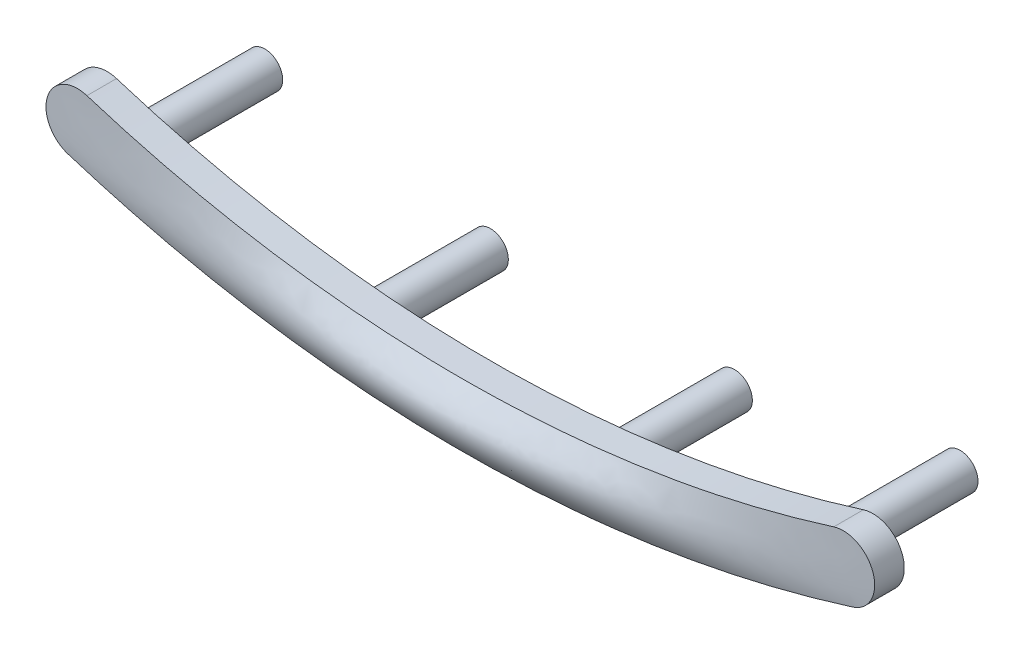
ISO-10303-21;
HEADER;
FILE_DESCRIPTION(('STEP AP214'),'2;1');
FILE_NAME('part.step','',(''),(''),'','','');
FILE_SCHEMA(('AUTOMOTIVE_DESIGN { 1 0 10303 214 1 1 1 1 }'));
ENDSEC;
DATA;
#1=APPLICATION_CONTEXT('core data for automotive mechanical design processes');
#2=APPLICATION_PROTOCOL_DEFINITION('international standard','automotive_design',2000,#1);
#3=PRODUCT_CONTEXT('',#1,'mechanical');
#4=PRODUCT('Part','Part','',(#3));
#5=PRODUCT_RELATED_PRODUCT_CATEGORY('part','',(#4));
#6=PRODUCT_DEFINITION_FORMATION('','',#4);
#7=PRODUCT_DEFINITION_CONTEXT('part definition',#1,'design');
#8=PRODUCT_DEFINITION('design','',#6,#7);
#9=PRODUCT_DEFINITION_SHAPE('','',#8);
#10=(LENGTH_UNIT() NAMED_UNIT(*) SI_UNIT(.MILLI.,.METRE.));
#11=(NAMED_UNIT(*) PLANE_ANGLE_UNIT() SI_UNIT($,.RADIAN.));
#12=(NAMED_UNIT(*) SI_UNIT($,.STERADIAN.) SOLID_ANGLE_UNIT());
#13=UNCERTAINTY_MEASURE_WITH_UNIT(LENGTH_MEASURE(1.E-05),#10,'distance_accuracy_value','');
#14=(GEOMETRIC_REPRESENTATION_CONTEXT(3) GLOBAL_UNCERTAINTY_ASSIGNED_CONTEXT((#13)) GLOBAL_UNIT_ASSIGNED_CONTEXT((#10,
#11,#12)) REPRESENTATION_CONTEXT('',''));
#15=CARTESIAN_POINT('',(0.,0.,0.));
#16=DIRECTION('',(0.,0.,1.));
#17=DIRECTION('',(1.,0.,0.));
#18=AXIS2_PLACEMENT_3D('',#15,#16,#17);
#19=CARTESIAN_POINT('',(139.623135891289,-1.58405602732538,-1.44999999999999));
#20=DIRECTION('',(0.,0.,1.));
#21=DIRECTION('',(0.,1.,0.));
#22=AXIS2_PLACEMENT_3D('',#19,#20,#21);
#23=PLANE('',#22);
#24=CARTESIAN_POINT('',(5.97500000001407,-62.7343556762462,-1.44999999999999));
#25=DIRECTION('',(0.,0.,1.));
#26=DIRECTION('',(1.,0.,0.));
#27=AXIS2_PLACEMENT_3D('',#24,#25,#26);
#28=CIRCLE('',#27,0.874999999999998);
#29=CARTESIAN_POINT('',(6.85000000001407,-62.7343556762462,-1.44999999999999));
#30=VERTEX_POINT('',#29);
#31=EDGE_CURVE('E134',#30,#30,#28,.F.);
#32=ORIENTED_EDGE('',*,*,#31,.F.);
#33=EDGE_LOOP('',(#32));
#34=FACE_BOUND('',#33,.T.);
#35=CARTESIAN_POINT('',(-17.0249999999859,-60.6392809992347,-1.44999999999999));
#36=DIRECTION('',(0.,0.,1.));
#37=DIRECTION('',(1.,0.,0.));
#38=AXIS2_PLACEMENT_3D('',#35,#36,#37);
#39=CIRCLE('',#38,0.875000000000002);
#40=CARTESIAN_POINT('',(-16.1499999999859,-60.6392809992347,-1.44999999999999));
#41=VERTEX_POINT('',#40);
#42=EDGE_CURVE('E187',#41,#41,#39,.F.);
#43=ORIENTED_EDGE('',*,*,#42,.F.);
#44=EDGE_LOOP('',(#43));
#45=FACE_BOUND('',#44,.T.);
#46=CARTESIAN_POINT('',(1.40716651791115E-11,-0.668442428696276,-1.44999999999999));
#47=DIRECTION('',(0.,0.,1.));
#48=DIRECTION('',(1.,0.,0.));
#49=AXIS2_PLACEMENT_3D('',#46,#47,#48);
#50=CIRCLE('',#49,63.8812271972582);
#51=CARTESIAN_POINT('',(19.2133657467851,-61.5918186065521,-1.44999999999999));
#52=VERTEX_POINT('',#51);
#53=CARTESIAN_POINT('',(-19.213365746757,-61.5918186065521,-1.44999999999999));
#54=VERTEX_POINT('',#53);
#55=EDGE_CURVE('E188',#52,#54,#50,.F.);
#56=ORIENTED_EDGE('',*,*,#55,.T.);
#57=CARTESIAN_POINT('',(-18.7499999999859,-60.1225390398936,-1.44999999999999));
#58=DIRECTION('',(0.,0.,1.));
#59=DIRECTION('',(1.,0.,0.));
#60=AXIS2_PLACEMENT_3D('',#57,#58,#59);
#61=CIRCLE('',#60,1.54061359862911);
#62=CARTESIAN_POINT('',(-18.2866342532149,-58.653259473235,-1.44999999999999));
#63=VERTEX_POINT('',#62);
#64=EDGE_CURVE('E174',#54,#63,#61,.F.);
#65=ORIENTED_EDGE('',*,*,#64,.T.);
#66=CARTESIAN_POINT('',(1.40716651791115E-11,-0.668442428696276,-1.44999999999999));
#67=DIRECTION('',(0.,0.,1.));
#68=DIRECTION('',(1.,0.,0.));
#69=AXIS2_PLACEMENT_3D('',#66,#67,#68);
#70=CIRCLE('',#69,60.8);
#71=CARTESIAN_POINT('',(18.286634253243,-58.6532594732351,-1.44999999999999));
#72=VERTEX_POINT('',#71);
#73=EDGE_CURVE('E170',#63,#72,#70,.T.);
#74=ORIENTED_EDGE('',*,*,#73,.T.);
#75=CARTESIAN_POINT('',(18.7500000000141,-60.1225390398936,-1.44999999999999));
#76=DIRECTION('',(0.,0.,1.));
#77=DIRECTION('',(1.,0.,0.));
#78=AXIS2_PLACEMENT_3D('',#75,#76,#77);
#79=CIRCLE('',#78,1.54061359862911);
#80=EDGE_CURVE('E142',#72,#52,#79,.F.);
#81=ORIENTED_EDGE('',*,*,#80,.T.);
#82=EDGE_LOOP('',(#56,#65,#74,#81));
#83=FACE_BOUND('',#82,.T.);
#84=CARTESIAN_POINT('',(-5.97499999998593,-62.7343556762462,-1.44999999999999));
#85=DIRECTION('',(0.,0.,1.));
#86=DIRECTION('',(1.,0.,0.));
#87=AXIS2_PLACEMENT_3D('',#84,#85,#86);
#88=CIRCLE('',#87,0.875000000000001);
#89=CARTESIAN_POINT('',(-5.09999999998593,-62.7343556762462,-1.44999999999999));
#90=VERTEX_POINT('',#89);
#91=EDGE_CURVE('E191',#90,#90,#88,.F.);
#92=ORIENTED_EDGE('',*,*,#91,.F.);
#93=EDGE_LOOP('',(#92));
#94=FACE_BOUND('',#93,.T.);
#95=CARTESIAN_POINT('',(17.0250000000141,-60.6392809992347,-1.44999999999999));
#96=DIRECTION('',(0.,0.,1.));
#97=DIRECTION('',(1.,0.,0.));
#98=AXIS2_PLACEMENT_3D('',#95,#96,#97);
#99=CIRCLE('',#98,0.875000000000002);
#100=CARTESIAN_POINT('',(17.9000000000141,-60.6392809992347,-1.44999999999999));
#101=VERTEX_POINT('',#100);
#102=EDGE_CURVE('E13',#101,#101,#99,.F.);
#103=ORIENTED_EDGE('',*,*,#102,.F.);
#104=EDGE_LOOP('',(#103));
#105=FACE_BOUND('',#104,.T.);
#106=ADVANCED_FACE('F124',(#34,#45,#83,#94,#105),#23,.F.);
#107=CARTESIAN_POINT('',(1.40716651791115E-11,-0.668442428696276,-42.4676787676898));
#108=DIRECTION('',(0.,0.,1.));
#109=DIRECTION('',(1.,0.,0.));
#110=AXIS2_PLACEMENT_3D('',#107,#108,#109);
#111=CYLINDRICAL_SURFACE('',#110,63.8812271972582);
#112=ORIENTED_EDGE('',*,*,#55,.F.);
#113=DIRECTION('',(0.,0.,1.));
#114=VECTOR('',#113,1.);
#115=CARTESIAN_POINT('',(19.2133657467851,-61.5918186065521,-42.4676787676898));
#116=LINE('',#115,#114);
#117=CARTESIAN_POINT('',(19.2133657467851,-61.5918186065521,-7.7103309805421E-05));
#118=VERTEX_POINT('',#117);
#119=EDGE_CURVE('E183',#52,#118,#116,.T.);
#120=ORIENTED_EDGE('',*,*,#119,.T.);
#121=CARTESIAN_POINT('',(-19.213365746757,-61.5918186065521,-7.71335734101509E-05));
#122=CARTESIAN_POINT('',(-19.1587162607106,-61.6090533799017,7.57055985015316E-05));
#123=CARTESIAN_POINT('',(-19.1040435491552,-61.6262146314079,0.000124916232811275));
#124=CARTESIAN_POINT('',(-18.9946521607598,-61.6603899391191,0.000128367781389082));
#125=CARTESIAN_POINT('',(-18.9399334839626,-61.6774039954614,8.26087841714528E-05));
#126=CARTESIAN_POINT('',(-18.8304506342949,-61.7112847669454,8.40834898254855E-06));
#127=CARTESIAN_POINT('',(-18.7756864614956,-61.7281514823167,-2.00331159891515E-05));
#128=CARTESIAN_POINT('',(-18.666112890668,-61.7617374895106,-5.02547434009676E-05));
#129=CARTESIAN_POINT('',(-18.6113034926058,-61.7784567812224,-5.20348858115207E-05));
#130=CARTESIAN_POINT('',(-18.4468097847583,-61.8283928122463,-4.63421006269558E-05));
#131=CARTESIAN_POINT('',(-18.3370581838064,-61.8613882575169,-2.7836376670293E-05));
#132=CARTESIAN_POINT('',(-18.117378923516,-61.9267880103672,-4.57060372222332E-06));
#133=CARTESIAN_POINT('',(-18.0074512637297,-61.9591923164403,1.89410240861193E-07));
#134=CARTESIAN_POINT('',(-17.6774257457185,-62.0555121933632,6.7374831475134E-06));
#135=CARTESIAN_POINT('',(-17.4570678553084,-62.1185400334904,7.95565635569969E-07));
#136=CARTESIAN_POINT('',(-17.0156846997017,-62.2422208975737,-3.97218363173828E-06));
#137=CARTESIAN_POINT('',(-16.7946594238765,-62.3028738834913,-2.79790145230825E-06));
#138=CARTESIAN_POINT('',(-16.1301964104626,-62.4813735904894,-3.83150984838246E-07));
#139=CARTESIAN_POINT('',(-15.6857890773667,-62.5956391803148,-2.55114133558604E-07));
#140=CARTESIAN_POINT('',(-14.7946171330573,-62.8145691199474,-1.53318820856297E-07));
#141=CARTESIAN_POINT('',(-14.3478524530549,-62.9192331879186,-1.79564886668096E-07));
#142=CARTESIAN_POINT('',(-12.881514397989,-63.2461256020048,-1.47415487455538E-08));
#143=CARTESIAN_POINT('',(-11.8573713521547,-63.4482384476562,4.95815048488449E-07));
#144=CARTESIAN_POINT('',(-9.80029849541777,-63.8020694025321,-1.73282078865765E-06));
#145=CARTESIAN_POINT('',(-8.76736726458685,-63.9537792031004,-4.47254867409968E-06));
#146=CARTESIAN_POINT('',(-6.69544074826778,-64.2063934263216,-3.94026118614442E-06));
#147=CARTESIAN_POINT('',(-5.65644631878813,-64.3073048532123,-6.69074905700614E-07));
#148=CARTESIAN_POINT('',(-3.57493001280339,-64.4580950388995,6.11144506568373E-07));
#149=CARTESIAN_POINT('',(-2.53240872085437,-64.5079818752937,-1.3789892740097E-06));
#150=CARTESIAN_POINT('',(-0.45086766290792,-64.5565226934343,-3.67421823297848E-06));
#151=CARTESIAN_POINT('',(0.58814674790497,-64.5554062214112,-3.98685606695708E-06));
#152=CARTESIAN_POINT('',(2.66453096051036,-64.5025216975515,-1.91260434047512E-06));
#153=CARTESIAN_POINT('',(3.70190119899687,-64.4507707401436,4.73374197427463E-07));
#154=CARTESIAN_POINT('',(5.77299289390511,-64.2967539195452,-6.80297620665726E-07));
#155=CARTESIAN_POINT('',(6.80671401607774,-64.194483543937,-4.22047737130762E-06));
#156=CARTESIAN_POINT('',(8.86805191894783,-63.9396665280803,-4.51289530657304E-06));
#157=CARTESIAN_POINT('',(9.89566770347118,-63.7871119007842,-1.26405469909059E-06));
#158=CARTESIAN_POINT('',(12.3216749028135,-63.3662349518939,1.04696802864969E-08));
#159=CARTESIAN_POINT('',(13.7163504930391,-63.0759617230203,-4.34552491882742E-06));
#160=CARTESIAN_POINT('',(15.791356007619,-62.5712019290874,1.80828749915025E-06));
#161=CARTESIAN_POINT('',(16.4803146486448,-62.3913509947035,5.97612086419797E-06));
#162=CARTESIAN_POINT('',(17.8518095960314,-62.0087290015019,-1.00979154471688E-05));
#163=CARTESIAN_POINT('',(18.5343461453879,-61.8059588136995,-3.03388577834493E-05));
#164=CARTESIAN_POINT('',(19.2133657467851,-61.5918186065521,-7.71033098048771E-05));
#165=B_SPLINE_CURVE_WITH_KNOTS('',3,(#121,#122,#123,#124,#125,#126,#127,#128,#129,#130,#131,
#132,#133,#134,#135,#136,#137,#138,#139,#140,#141,#142,#143,#144,#145,#146,#147,#148,#149,#150,
#151,#152,#153,#154,#155,#156,#157,#158,#159,#160,#161,#162,#163,#164),.UNSPECIFIED.,.F.,.F.,(4,
2,2,2,2,2,2,2,2,2,2,2,2,2,2,2,2,2,2,2,2,4),(0.,0.171908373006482,0.343816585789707,
0.515724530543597,0.6876326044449,1.03144317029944,1.37525461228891,2.06282265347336,
2.75040170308,4.12686458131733,5.50336785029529,8.63367154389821,11.7644909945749,
14.8948786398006,18.0247706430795,21.1405776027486,24.2553330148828,27.3703666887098,
30.485895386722,34.7559436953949,36.8917513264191,39.0274778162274),.UNSPECIFIED.);
#166=CARTESIAN_POINT('',(-19.213365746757,-61.5918186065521,-7.71335734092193E-05));
#167=VERTEX_POINT('',#166);
#168=EDGE_CURVE('E199',#167,#118,#165,.T.);
#169=ORIENTED_EDGE('',*,*,#168,.F.);
#170=DIRECTION('',(0.,0.,1.));
#171=VECTOR('',#170,1.);
#172=CARTESIAN_POINT('',(-19.213365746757,-61.5918186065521,-42.4676787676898));
#173=LINE('',#172,#171);
#174=EDGE_CURVE('E175',#54,#167,#173,.T.);
#175=ORIENTED_EDGE('',*,*,#174,.F.);
#176=EDGE_LOOP('',(#112,#120,#169,#175));
#177=FACE_BOUND('',#176,.T.);
#178=ADVANCED_FACE('F126',(#177),#111,.T.);
#179=CARTESIAN_POINT('',(-18.7499999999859,-60.1225390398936,-42.4676787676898));
#180=DIRECTION('',(0.,0.,1.));
#181=DIRECTION('',(1.,0.,0.));
#182=AXIS2_PLACEMENT_3D('',#179,#180,#181);
#183=CYLINDRICAL_SURFACE('',#182,1.54061359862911);
#184=ORIENTED_EDGE('',*,*,#64,.F.);
#185=ORIENTED_EDGE('',*,*,#174,.T.);
#186=CARTESIAN_POINT('',(-18.2866342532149,-58.6532594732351,-3.13011022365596E-05));
#187=CARTESIAN_POINT('',(-18.3279710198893,-58.6402234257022,-5.01798386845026E-05));
#188=CARTESIAN_POINT('',(-18.3698382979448,-58.6289386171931,-5.17615311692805E-05));
#189=CARTESIAN_POINT('',(-18.4543721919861,-58.6099342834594,-3.81652288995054E-05));
#190=CARTESIAN_POINT('',(-18.4970387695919,-58.602214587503,-2.29880368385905E-05));
#191=CARTESIAN_POINT('',(-18.6257138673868,-58.5845146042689,2.08871237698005E-05));
#192=CARTESIAN_POINT('',(-18.7125314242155,-58.5799514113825,4.79822832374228E-05));
#193=CARTESIAN_POINT('',(-18.8856964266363,-58.585465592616,6.46341389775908E-05));
#194=CARTESIAN_POINT('',(-18.9720436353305,-58.5955497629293,5.41734064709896E-05));
#195=CARTESIAN_POINT('',(-19.1418143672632,-58.6300682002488,1.98687172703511E-05));
#196=CARTESIAN_POINT('',(-19.22523846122,-58.6544996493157,-3.97261130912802E-06));
#197=CARTESIAN_POINT('',(-19.3868001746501,-58.7170212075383,-3.66585179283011E-05));
#198=CARTESIAN_POINT('',(-19.4649376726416,-58.7551116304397,-4.55027514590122E-05));
#199=CARTESIAN_POINT('',(-19.6137216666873,-58.8438757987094,-3.99053218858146E-05));
#200=CARTESIAN_POINT('',(-19.6843670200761,-58.89455145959,-2.54601122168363E-05));
#201=CARTESIAN_POINT('',(-19.8161433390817,-59.0070421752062,4.58886098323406E-06));
#202=CARTESIAN_POINT('',(-19.8772747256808,-59.0688567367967,2.01925732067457E-05));
#203=CARTESIAN_POINT('',(-19.9882882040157,-59.2018675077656,2.80078823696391E-05));
#204=CARTESIAN_POINT('',(-20.0381710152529,-59.2730631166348,2.02209759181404E-05));
#205=CARTESIAN_POINT('',(-20.1252771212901,-59.4228199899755,-4.62193393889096E-06));
#206=CARTESIAN_POINT('',(-20.1625001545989,-59.5013814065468,-2.16781287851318E-05));
#207=CARTESIAN_POINT('',(-20.2232298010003,-59.6636394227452,-1.70656447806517E-05));
#208=CARTESIAN_POINT('',(-20.2467360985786,-59.7473361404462,4.60392479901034E-06));
#209=CARTESIAN_POINT('',(-20.2793618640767,-59.9174901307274,1.89751673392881E-05));
#210=CARTESIAN_POINT('',(-20.2884814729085,-60.0039473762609,1.16771240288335E-05));
#211=CARTESIAN_POINT('',(-20.2920814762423,-60.1771544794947,-2.17255951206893E-06));
#212=CARTESIAN_POINT('',(-20.2865619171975,-60.2639043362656,-8.72420211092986E-06));
#213=CARTESIAN_POINT('',(-20.2610174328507,-60.4352895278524,-7.85949204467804E-06));
#214=CARTESIAN_POINT('',(-20.2409921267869,-60.5199248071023,-4.42772715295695E-07));
#215=CARTESIAN_POINT('',(-20.2005596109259,-60.6433547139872,5.70015403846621E-06));
#216=CARTESIAN_POINT('',(-20.1853460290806,-60.6839177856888,6.91720945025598E-06));
#217=CARTESIAN_POINT('',(-20.1515456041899,-60.7636605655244,6.69412173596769E-06));
#218=CARTESIAN_POINT('',(-20.1329555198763,-60.8028389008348,5.25141309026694E-06));
#219=CARTESIAN_POINT('',(-20.072347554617,-60.9177579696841,-8.24895629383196E-07));
#220=CARTESIAN_POINT('',(-20.0254555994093,-60.9909933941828,-7.20585773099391E-06));
#221=CARTESIAN_POINT('',(-19.9200275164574,-61.1285375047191,-4.18301190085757E-05));
#222=CARTESIAN_POINT('',(-19.8614918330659,-61.1928465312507,-7.00725840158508E-05));
#223=CARTESIAN_POINT('',(-19.7662511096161,-61.2812502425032,-1.70356639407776E-05));
#224=CARTESIAN_POINT('',(-19.7332264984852,-61.3093998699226,1.66281075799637E-05));
#225=CARTESIAN_POINT('',(-19.664941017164,-61.3628001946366,8.6256323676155E-05));
#226=CARTESIAN_POINT('',(-19.6296819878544,-61.3880532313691,0.000122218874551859));
#227=CARTESIAN_POINT('',(-19.5571998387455,-61.4354721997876,0.000159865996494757));
#228=CARTESIAN_POINT('',(-19.5199786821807,-61.4576411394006,0.000161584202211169));
#229=CARTESIAN_POINT('',(-19.4438088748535,-61.4987626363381,7.87998998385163E-05));
#230=CARTESIAN_POINT('',(-19.4048607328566,-61.5177161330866,-5.67737460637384E-06));
#231=CARTESIAN_POINT('',(-19.3403867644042,-61.5457980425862,-0.000121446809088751));
#232=CARTESIAN_POINT('',(-19.3153000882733,-61.5559467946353,-0.000160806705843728));
#233=CARTESIAN_POINT('',(-19.2646692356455,-61.57489414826,-0.000177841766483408));
#234=CARTESIAN_POINT('',(-19.2391258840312,-61.5836949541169,-0.000155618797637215));
#235=CARTESIAN_POINT('',(-19.213365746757,-61.591818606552,-7.7133573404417E-05));
#236=B_SPLINE_CURVE_WITH_KNOTS('',3,(#186,#187,#188,#189,#190,#191,#192,#193,#194,#195,#196,
#197,#198,#199,#200,#201,#202,#203,#204,#205,#206,#207,#208,#209,#210,#211,#212,#213,#214,#215,
#216,#217,#218,#219,#220,#221,#222,#223,#224,#225,#226,#227,#228,#229,#230,#231,#232,#233,#234,
#235),.UNSPECIFIED.,.F.,.F.,(4,2,2,2,2,2,2,2,2,2,2,2,2,2,2,2,2,2,2,2,2,2,2,2,4),(0.,
0.129950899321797,0.259895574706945,0.519369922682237,0.778964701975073,1.0385085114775,
1.29805828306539,1.55764758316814,1.81722539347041,2.07678659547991,2.33635315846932,
2.59592569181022,2.85549568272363,3.11506484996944,3.37464083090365,3.50447526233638,
3.63443499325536,3.89400959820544,4.1535742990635,4.28362702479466,4.41357396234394,
4.54339326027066,4.67317456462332,4.75432542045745,4.83534212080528),.UNSPECIFIED.);
#237=CARTESIAN_POINT('',(-18.2866342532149,-58.653259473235,-3.13011022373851E-05));
#238=VERTEX_POINT('',#237);
#239=EDGE_CURVE('E168',#238,#167,#236,.T.);
#240=ORIENTED_EDGE('',*,*,#239,.F.);
#241=DIRECTION('',(0.,0.,1.));
#242=VECTOR('',#241,1.);
#243=CARTESIAN_POINT('',(-18.2866342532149,-58.653259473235,-42.4676787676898));
#244=LINE('',#243,#242);
#245=EDGE_CURVE('E162',#63,#238,#244,.T.);
#246=ORIENTED_EDGE('',*,*,#245,.F.);
#247=EDGE_LOOP('',(#184,#185,#240,#246));
#248=FACE_BOUND('',#247,.T.);
#249=ADVANCED_FACE('F238',(#248),#183,.T.);
#250=CARTESIAN_POINT('',(1.40716651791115E-11,-0.668442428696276,-42.4676787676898));
#251=DIRECTION('',(0.,0.,1.));
#252=DIRECTION('',(1.,0.,0.));
#253=AXIS2_PLACEMENT_3D('',#250,#251,#252);
#254=CYLINDRICAL_SURFACE('',#253,60.8);
#255=ORIENTED_EDGE('',*,*,#73,.F.);
#256=ORIENTED_EDGE('',*,*,#245,.T.);
#257=CARTESIAN_POINT('',(18.286634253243,-58.6532594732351,-3.13288623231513E-05));
#258=CARTESIAN_POINT('',(18.1813771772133,-58.68645432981,1.52709247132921E-05));
#259=CARTESIAN_POINT('',(18.0760299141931,-58.7193625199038,3.11958608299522E-05));
#260=CARTESIAN_POINT('',(17.8651578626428,-58.7846046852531,3.46072700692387E-05));
#261=CARTESIAN_POINT('',(17.7596330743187,-58.8169386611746,2.2093776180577E-05));
#262=CARTESIAN_POINT('',(17.4428003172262,-58.9130768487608,-8.73722036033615E-06));
#263=CARTESIAN_POINT('',(17.2312299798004,-58.9760185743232,-2.03459640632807E-05));
#264=CARTESIAN_POINT('',(16.8074173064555,-59.099593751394,-1.68279995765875E-05));
#265=CARTESIAN_POINT('',(16.5951749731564,-59.1602272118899,-1.7013954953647E-06));
#266=CARTESIAN_POINT('',(16.1700398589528,-59.279179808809,1.28368114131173E-05));
#267=CARTESIAN_POINT('',(15.9571470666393,-59.3374989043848,1.22481369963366E-05));
#268=CARTESIAN_POINT('',(15.3175753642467,-59.5089618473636,6.08685463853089E-06));
#269=CARTESIAN_POINT('',(14.8899562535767,-59.6186250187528,-3.8801705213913E-06));
#270=CARTESIAN_POINT('',(14.0324332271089,-59.8286124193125,-7.91898156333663E-06));
#271=CARTESIAN_POINT('',(13.6025292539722,-59.9289364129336,-1.99036664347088E-06));
#272=CARTESIAN_POINT('',(12.3093076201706,-60.2159100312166,8.46864734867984E-06));
#273=CARTESIAN_POINT('',(11.4428109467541,-60.3884726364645,5.66193949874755E-06));
#274=CARTESIAN_POINT('',(9.70317318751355,-60.6956767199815,1.23709680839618E-06));
#275=CARTESIAN_POINT('',(8.83003193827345,-60.8303172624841,-3.81008703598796E-07));
#276=CARTESIAN_POINT('',(6.81659191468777,-61.0960064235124,4.40436536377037E-06));
#277=CARTESIAN_POINT('',(5.67450774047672,-61.2139325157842,1.33521924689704E-05));
#278=CARTESIAN_POINT('',(4.24410018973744,-61.3208126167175,-1.46235667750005E-05));
#279=CARTESIAN_POINT('',(3.95783349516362,-61.3401647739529,-2.21784476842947E-05));
#280=CARTESIAN_POINT('',(3.38505739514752,-61.3748151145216,-3.75528271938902E-06));
#281=CARTESIAN_POINT('',(3.09854799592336,-61.3901133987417,2.22219285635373E-05));
#282=CARTESIAN_POINT('',(2.23872126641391,-61.4299220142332,3.75269343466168E-05));
#283=CARTESIAN_POINT('',(1.66510699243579,-61.4483459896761,-3.57723908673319E-05));
#284=CARTESIAN_POINT('',(0.804446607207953,-61.4637977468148,5.49847353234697E-06));
#285=CARTESIAN_POINT('',(0.517493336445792,-61.4669173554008,4.44693752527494E-05));
#286=CARTESIAN_POINT('',(-0.0564308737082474,-61.4690934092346,7.33729497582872E-05));
#287=CARTESIAN_POINT('',(-0.343401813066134,-61.4681498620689,6.33057141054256E-05));
#288=CARTESIAN_POINT('',(-0.917302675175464,-61.4621995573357,1.7129957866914E-05));
#289=CARTESIAN_POINT('',(-1.20423259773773,-61.4571927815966,-1.89786791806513E-05));
#290=CARTESIAN_POINT('',(-1.77799091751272,-61.4431172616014,-2.3327607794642E-05));
#291=CARTESIAN_POINT('',(-2.06481931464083,-61.4340485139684,8.43215706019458E-06));
#292=CARTESIAN_POINT('',(-2.92504995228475,-61.4007520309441,4.74842735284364E-05));
#293=CARTESIAN_POINT('',(-3.49822941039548,-61.3704337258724,-1.44081479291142E-06));
#294=CARTESIAN_POINT('',(-4.64346920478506,-61.2935822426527,-3.01601822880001E-05));
#295=CARTESIAN_POINT('',(-5.21552957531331,-61.2470495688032,-9.95661132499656E-06));
#296=CARTESIAN_POINT('',(-6.49359753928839,-61.1248502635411,1.04315929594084E-05));
#297=CARTESIAN_POINT('',(-7.19919952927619,-61.0448915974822,4.73281961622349E-06));
#298=CARTESIAN_POINT('',(-8.60714923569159,-60.8603113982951,-8.93709195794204E-07));
#299=CARTESIAN_POINT('',(-9.30949701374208,-60.7556903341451,-8.21574394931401E-07));
#300=CARTESIAN_POINT('',(-10.7100933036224,-60.5219132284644,-2.34527796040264E-06));
#301=CARTESIAN_POINT('',(-11.4083418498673,-60.3927573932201,-3.94110230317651E-06));
#302=CARTESIAN_POINT('',(-12.7997465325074,-60.1100976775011,-4.39678788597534E-06));
#303=CARTESIAN_POINT('',(-13.4929036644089,-59.9565986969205,-3.25719907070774E-06));
#304=CARTESIAN_POINT('',(-14.8734256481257,-59.6254186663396,4.61604724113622E-06));
#305=CARTESIAN_POINT('',(-15.5607904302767,-59.4477373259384,1.13497719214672E-05));
#306=CARTESIAN_POINT('',(-16.9288957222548,-59.068413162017,8.12058678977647E-06));
#307=CARTESIAN_POINT('',(-17.6096360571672,-58.8667697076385,-1.8427627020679E-06));
#308=CARTESIAN_POINT('',(-18.2866342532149,-58.653259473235,-3.13011022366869E-05));
#309=B_SPLINE_CURVE_WITH_KNOTS('',3,(#257,#258,#259,#260,#261,#262,#263,#264,#265,#266,#267,
#268,#269,#270,#271,#272,#273,#274,#275,#276,#277,#278,#279,#280,#281,#282,#283,#284,#285,#286,
#287,#288,#289,#290,#291,#292,#293,#294,#295,#296,#297,#298,#299,#300,#301,#302,#303,#304,#305,
#306,#307,#308),.UNSPECIFIED.,.F.,.F.,(4,2,2,2,2,2,2,2,2,2,2,2,2,2,2,2,2,2,2,2,2,2,2,2,2,4),(0.,
0.331101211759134,0.66220203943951,1.32439118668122,1.98657775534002,2.64877600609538,
3.97302605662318,5.29730949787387,7.94690266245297,10.5965612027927,14.0388311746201,
14.8995792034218,15.7603058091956,17.4817637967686,18.3426526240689,19.2035398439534,
20.064430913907,20.9253226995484,22.6470109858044,24.3686457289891,26.4985466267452,
28.6284070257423,30.7582495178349,32.8876638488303,35.01710375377,37.146599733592),.UNSPECIFIED.);
#310=CARTESIAN_POINT('',(18.286634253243,-58.6532594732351,-3.1328862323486E-05));
#311=VERTEX_POINT('',#310);
#312=EDGE_CURVE('E179',#311,#238,#309,.T.);
#313=ORIENTED_EDGE('',*,*,#312,.F.);
#314=DIRECTION('',(0.,0.,1.));
#315=VECTOR('',#314,1.);
#316=CARTESIAN_POINT('',(18.286634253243,-58.6532594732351,-42.4676787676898));
#317=LINE('',#316,#315);
#318=EDGE_CURVE('E177',#72,#311,#317,.T.);
#319=ORIENTED_EDGE('',*,*,#318,.F.);
#320=EDGE_LOOP('',(#255,#256,#313,#319));
#321=FACE_BOUND('',#320,.T.);
#322=ADVANCED_FACE('F178',(#321),#254,.F.);
#323=CARTESIAN_POINT('',(18.7500000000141,-60.1225390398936,-42.4676787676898));
#324=DIRECTION('',(0.,0.,1.));
#325=DIRECTION('',(1.,0.,0.));
#326=AXIS2_PLACEMENT_3D('',#323,#324,#325);
#327=CYLINDRICAL_SURFACE('',#326,1.54061359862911);
#328=ORIENTED_EDGE('',*,*,#80,.F.);
#329=ORIENTED_EDGE('',*,*,#318,.T.);
#330=CARTESIAN_POINT('',(19.2133657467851,-61.5918186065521,-7.71033098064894E-05));
#331=CARTESIAN_POINT('',(19.2546907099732,-61.5787903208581,-0.000191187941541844));
#332=CARTESIAN_POINT('',(19.2954614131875,-61.564011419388,-0.000180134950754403));
#333=CARTESIAN_POINT('',(19.3756122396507,-61.5310750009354,-7.19169680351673E-05));
#334=CARTESIAN_POINT('',(19.4149924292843,-61.5129176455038,2.52439072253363E-05));
#335=CARTESIAN_POINT('',(19.4920570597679,-61.4733595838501,0.000141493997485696));
#336=CARTESIAN_POINT('',(19.5297426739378,-61.4519611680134,0.000160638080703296));
#337=CARTESIAN_POINT('',(19.6031698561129,-61.406076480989,0.000144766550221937));
#338=CARTESIAN_POINT('',(19.6389114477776,-61.3815902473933,0.000109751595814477));
#339=CARTESIAN_POINT('',(19.7428679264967,-61.3037182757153,9.62752320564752E-06));
#340=CARTESIAN_POINT('',(19.8078475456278,-61.2459022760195,-5.05946177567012E-05));
#341=CARTESIAN_POINT('',(19.9271285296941,-61.1202234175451,-6.667307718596E-05));
#342=CARTESIAN_POINT('',(19.9814319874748,-61.0523625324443,-2.2549872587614E-05));
#343=CARTESIAN_POINT('',(20.0778893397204,-60.908476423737,1.57651093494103E-05));
#344=CARTESIAN_POINT('',(20.1200426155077,-60.8324507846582,9.95434455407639E-06));
#345=CARTESIAN_POINT('',(20.1909911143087,-60.6743920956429,3.03048345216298E-06));
#346=CARTESIAN_POINT('',(20.2197843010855,-60.5923581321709,1.91810302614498E-06));
#347=CARTESIAN_POINT('',(20.2631884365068,-60.4246232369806,-5.23996934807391E-06));
#348=CARTESIAN_POINT('',(20.2777999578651,-60.3389224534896,-1.12854620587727E-05));
#349=CARTESIAN_POINT('',(20.2924266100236,-60.1662899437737,-2.88997996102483E-06));
#350=CARTESIAN_POINT('',(20.2924426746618,-60.0793582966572,1.15496841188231E-05));
#351=CARTESIAN_POINT('',(20.2778801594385,-59.9067241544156,1.5391963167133E-05));
#352=CARTESIAN_POINT('',(20.2633012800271,-59.8210216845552,4.79406425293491E-06));
#353=CARTESIAN_POINT('',(20.2199626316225,-59.653279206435,-1.30746408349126E-05));
#354=CARTESIAN_POINT('',(20.1912025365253,-59.5712392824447,-2.03453704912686E-05));
#355=CARTESIAN_POINT('',(20.1203146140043,-59.4131515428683,-8.20611467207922E-06));
#356=CARTESIAN_POINT('',(20.0781869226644,-59.3371036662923,1.12035991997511E-05));
#357=CARTESIAN_POINT('',(19.9817728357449,-59.1931662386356,2.83608577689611E-05));
#358=CARTESIAN_POINT('',(19.9274864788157,-59.1252766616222,2.6108471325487E-05));
#359=CARTESIAN_POINT('',(19.8082456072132,-58.9995507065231,5.08940761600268E-06));
#360=CARTESIAN_POINT('',(19.7432908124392,-58.9417145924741,-1.36777033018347E-05));
#361=CARTESIAN_POINT('',(19.6393655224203,-58.8638090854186,-3.33402344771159E-05));
#362=CARTESIAN_POINT('',(19.603634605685,-58.8393117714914,-3.84798819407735E-05));
#363=CARTESIAN_POINT('',(19.5302034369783,-58.7933853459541,-4.3835056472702E-05));
#364=CARTESIAN_POINT('',(19.4925013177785,-58.7719592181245,-4.40458267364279E-05));
#365=CARTESIAN_POINT('',(19.3769326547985,-58.7125988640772,-3.60114892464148E-05));
#366=CARTESIAN_POINT('',(19.2965105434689,-58.6795128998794,-1.91232927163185E-05));
#367=CARTESIAN_POINT('',(19.1312532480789,-58.6273318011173,2.02213825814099E-05));
#368=CARTESIAN_POINT('',(19.0464182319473,-58.6082361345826,4.26776495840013E-05));
#369=CARTESIAN_POINT('',(18.9176876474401,-58.5904630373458,5.81552734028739E-05));
#370=CARTESIAN_POINT('',(18.8744854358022,-58.5863518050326,6.02727181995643E-05));
#371=CARTESIAN_POINT('',(18.7879302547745,-58.5817826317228,5.66955346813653E-05));
#372=CARTESIAN_POINT('',(18.7445774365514,-58.5813217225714,5.10072577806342E-05));
#373=CARTESIAN_POINT('',(18.614770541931,-58.5854418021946,2.03691272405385E-05));
#374=CARTESIAN_POINT('',(18.5283929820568,-58.5955015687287,-1.81221531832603E-05));
#375=CARTESIAN_POINT('',(18.417092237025,-58.6180785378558,-4.47140324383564E-05));
#376=CARTESIAN_POINT('',(18.3907211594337,-58.6241585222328,-4.92661754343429E-05));
#377=CARTESIAN_POINT('',(18.3383789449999,-58.6376873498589,-4.88721432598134E-05));
#378=CARTESIAN_POINT('',(18.3124072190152,-58.6451339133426,-4.39416592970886E-05));
#379=CARTESIAN_POINT('',(18.286634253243,-58.653259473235,-3.13288623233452E-05));
#380=B_SPLINE_CURVE_WITH_KNOTS('',3,(#330,#331,#332,#333,#334,#335,#336,#337,#338,#339,#340,
#341,#342,#343,#344,#345,#346,#347,#348,#349,#350,#351,#352,#353,#354,#355,#356,#357,#358,#359,
#360,#361,#362,#363,#364,#365,#366,#367,#368,#369,#370,#371,#372,#373,#374,#375,#376,#377,#378,
#379),.UNSPECIFIED.,.F.,.F.,(4,2,2,2,2,2,2,2,2,2,2,2,2,2,2,2,2,2,2,2,2,2,2,2,4),(0.,
0.129947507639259,0.259888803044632,0.38973869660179,0.519587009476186,0.779173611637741,
1.03870927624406,1.29825815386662,1.55784657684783,1.81742451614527,2.07698584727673,
2.33655250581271,2.59612513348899,2.85569511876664,3.11526427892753,3.37484025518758,
3.50467468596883,3.63463441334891,3.89420895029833,4.15377361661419,4.2838265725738,
4.41377376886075,4.67314440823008,4.75431050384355,4.83534240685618),.UNSPECIFIED.);
#381=EDGE_CURVE('E205',#118,#311,#380,.T.);
#382=ORIENTED_EDGE('',*,*,#381,.F.);
#383=ORIENTED_EDGE('',*,*,#119,.F.);
#384=EDGE_LOOP('',(#328,#329,#382,#383));
#385=FACE_BOUND('',#384,.T.);
#386=ADVANCED_FACE('F186',(#385),#327,.T.);
#387=CARTESIAN_POINT('',(-20.7733244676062,-65.5659857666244,-2.20760332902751));
#388=CARTESIAN_POINT('',(-20.7733244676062,-65.4021989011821,-2.08490393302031));
#389=CARTESIAN_POINT('',(-20.7733244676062,-65.2384120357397,-1.9647032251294));
#390=CARTESIAN_POINT('',(-20.7733244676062,-65.0746251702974,-1.84690955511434));
#391=CARTESIAN_POINT('',(-20.7733244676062,-64.7469047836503,-1.61528936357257));
#392=CARTESIAN_POINT('',(-20.7733244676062,-64.4191843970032,-1.39175908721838));
#393=CARTESIAN_POINT('',(-20.7733244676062,-64.2552508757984,-1.2819284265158));
#394=CARTESIAN_POINT('',(-20.7733244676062,-63.9470816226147,-1.07971125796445));
#395=CARTESIAN_POINT('',(-20.7733244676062,-63.638912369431,-0.888147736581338));
#396=CARTESIAN_POINT('',(-20.7733244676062,-63.4946766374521,-0.801323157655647));
#397=CARTESIAN_POINT('',(-20.7733244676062,-63.2042967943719,-0.633824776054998));
#398=CARTESIAN_POINT('',(-20.7733244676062,-62.9139169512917,-0.48443386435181));
#399=CARTESIAN_POINT('',(-20.7733244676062,-62.7677728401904,-0.414705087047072));
#400=CARTESIAN_POINT('',(-20.7733244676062,-62.5273642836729,-0.310447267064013));
#401=CARTESIAN_POINT('',(-20.7733244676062,-62.2869557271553,-0.224718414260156));
#402=CARTESIAN_POINT('',(-20.7733244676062,-62.1926912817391,-0.194102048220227));
#403=CARTESIAN_POINT('',(-20.7733244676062,-62.0512946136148,-0.152717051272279));
#404=CARTESIAN_POINT('',(-20.7733244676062,-61.9098979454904,-0.118381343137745));
#405=CARTESIAN_POINT('',(-20.7733244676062,-61.8627657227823,-0.107762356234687));
#406=CARTESIAN_POINT('',(-20.7733244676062,-61.7802969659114,-0.0906385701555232));
#407=CARTESIAN_POINT('',(-20.7733244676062,-61.6978282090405,-0.0764169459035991));
#408=CARTESIAN_POINT('',(-20.7733244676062,-61.6624916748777,-0.0709021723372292));
#409=CARTESIAN_POINT('',(-20.7733244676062,-61.5830495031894,-0.0599584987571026));
#410=CARTESIAN_POINT('',(-20.7733244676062,-61.5036073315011,-0.0521707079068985));
#411=CARTESIAN_POINT('',(-20.7733244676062,-61.4595016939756,-0.048778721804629));
#412=CARTESIAN_POINT('',(-20.7733244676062,-61.327184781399,-0.0403364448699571));
#413=CARTESIAN_POINT('',(-20.7733244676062,-61.1948678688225,-0.0353062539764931));
#414=CARTESIAN_POINT('',(-20.7733244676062,-61.1066565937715,-0.0320004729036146));
#415=CARTESIAN_POINT('',(-20.7733244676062,-60.8020866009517,-0.0228345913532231));
#416=CARTESIAN_POINT('',(-20.7733244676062,-60.4975166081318,-0.0178693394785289));
#417=CARTESIAN_POINT('',(-20.7733244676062,-60.281157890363,-0.0157333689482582));
#418=CARTESIAN_POINT('',(-20.7733244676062,-59.7937299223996,-0.0130692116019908));
#419=CARTESIAN_POINT('',(-20.7733244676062,-59.3063019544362,-0.0141449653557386));
#420=CARTESIAN_POINT('',(-20.7733244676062,-59.0352327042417,-0.0136808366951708));
#421=CARTESIAN_POINT('',(-20.7733244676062,-58.7641634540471,-0.0151822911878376));
#422=CARTESIAN_POINT('',(-20.7733244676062,-58.4930942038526,-0.0160818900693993));
#423=CARTESIAN_POINT('',(-20.2759864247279,-65.5659857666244,-2.17588194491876));
#424=CARTESIAN_POINT('',(-20.2759864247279,-65.4021989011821,-2.05234517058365));
#425=CARTESIAN_POINT('',(-20.2759864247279,-65.2384120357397,-1.93132395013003));
#426=CARTESIAN_POINT('',(-20.2759864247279,-65.0746251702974,-1.81277954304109));
#427=CARTESIAN_POINT('',(-20.2759864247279,-64.7469047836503,-1.57983176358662));
#428=CARTESIAN_POINT('',(-20.2759864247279,-64.4191843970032,-1.35545386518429));
#429=CARTESIAN_POINT('',(-20.2759864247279,-64.2552508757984,-1.24534684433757));
#430=CARTESIAN_POINT('',(-20.2759864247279,-63.9470816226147,-1.0429475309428));
#431=CARTESIAN_POINT('',(-20.2759864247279,-63.638912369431,-0.851939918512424));
#432=CARTESIAN_POINT('',(-20.2759864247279,-63.4946766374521,-0.765557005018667));
#433=CARTESIAN_POINT('',(-20.2759864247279,-63.2042967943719,-0.599360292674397));
#434=CARTESIAN_POINT('',(-20.2759864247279,-62.9139169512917,-0.452124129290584));
#435=CARTESIAN_POINT('',(-20.2759864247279,-62.7677728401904,-0.383700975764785));
#436=CARTESIAN_POINT('',(-20.2759864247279,-62.5273642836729,-0.281931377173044));
#437=CARTESIAN_POINT('',(-20.2759864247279,-62.2869557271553,-0.199068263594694));
#438=CARTESIAN_POINT('',(-20.2759864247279,-62.1926912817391,-0.169602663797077));
#439=CARTESIAN_POINT('',(-20.2759864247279,-62.0512946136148,-0.129980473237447));
#440=CARTESIAN_POINT('',(-20.2759864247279,-61.9098979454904,-0.0971747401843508));
#441=CARTESIAN_POINT('',(-20.2759864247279,-61.8627657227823,-0.086990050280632));
#442=CARTESIAN_POINT('',(-20.2759864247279,-61.7802969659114,-0.0704548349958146));
#443=CARTESIAN_POINT('',(-20.2759864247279,-61.6978282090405,-0.0565015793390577));
#444=CARTESIAN_POINT('',(-20.2759864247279,-61.6624916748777,-0.0510229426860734));
#445=CARTESIAN_POINT('',(-20.2759864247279,-61.5830495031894,-0.0402062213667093));
#446=CARTESIAN_POINT('',(-20.2759864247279,-61.5036073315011,-0.0324660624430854));
#447=CARTESIAN_POINT('',(-20.2759864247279,-61.4595016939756,-0.0291517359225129));
#448=CARTESIAN_POINT('',(-20.2759864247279,-61.327184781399,-0.0209167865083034));
#449=CARTESIAN_POINT('',(-20.2759864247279,-61.1948678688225,-0.0157362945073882));
#450=CARTESIAN_POINT('',(-20.2759864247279,-61.1066565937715,-0.012408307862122));
#451=CARTESIAN_POINT('',(-20.2759864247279,-60.8020866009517,-0.00345690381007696));
#452=CARTESIAN_POINT('',(-20.2759864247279,-60.4975166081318,0.000591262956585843));
#453=CARTESIAN_POINT('',(-20.2759864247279,-60.281157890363,0.00166762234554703));
#454=CARTESIAN_POINT('',(-20.2759864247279,-59.7937299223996,0.00148914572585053));
#455=CARTESIAN_POINT('',(-20.2759864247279,-59.3063019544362,-0.00311932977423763));
#456=CARTESIAN_POINT('',(-20.2759864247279,-59.0352327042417,-0.00462306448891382));
#457=CARTESIAN_POINT('',(-20.2759864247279,-58.7641634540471,-0.00695538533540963));
#458=CARTESIAN_POINT('',(-20.2759864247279,-58.4930942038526,-0.00841129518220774));
#459=CARTESIAN_POINT('',(-19.7786483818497,-65.5659857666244,-2.14340800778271));
#460=CARTESIAN_POINT('',(-19.7786483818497,-65.4021989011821,-2.01902915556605));
#461=CARTESIAN_POINT('',(-19.7786483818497,-65.2384120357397,-1.89717050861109));
#462=CARTESIAN_POINT('',(-19.7786483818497,-65.0746251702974,-1.7778520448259));
#463=CARTESIAN_POINT('',(-19.7786483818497,-64.7469047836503,-1.54352566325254));
#464=CARTESIAN_POINT('',(-19.7786483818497,-64.4191843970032,-1.31823876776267));
#465=CARTESIAN_POINT('',(-19.7786483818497,-64.2552508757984,-1.2078231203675));
#466=CARTESIAN_POINT('',(-19.7786483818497,-63.9470816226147,-1.00518523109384));
#467=CARTESIAN_POINT('',(-19.7786483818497,-63.638912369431,-0.81468472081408));
#468=CARTESIAN_POINT('',(-19.7786483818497,-63.4946766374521,-0.728725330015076));
#469=CARTESIAN_POINT('',(-19.7786483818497,-63.2042967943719,-0.563803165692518));
#470=CARTESIAN_POINT('',(-19.7786483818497,-62.9139169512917,-0.418725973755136));
#471=CARTESIAN_POINT('',(-19.7786483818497,-62.7677728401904,-0.351621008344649));
#472=CARTESIAN_POINT('',(-19.7786483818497,-62.5273642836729,-0.252374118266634));
#473=CARTESIAN_POINT('',(-19.7786483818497,-62.2869557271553,-0.172468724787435));
#474=CARTESIAN_POINT('',(-19.7786483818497,-62.1926912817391,-0.144204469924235));
#475=CARTESIAN_POINT('',(-19.7786483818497,-62.0512946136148,-0.106472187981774));
#476=CARTESIAN_POINT('',(-19.7786483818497,-61.9098979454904,-0.0754355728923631));
#477=CARTESIAN_POINT('',(-19.7786483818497,-61.8627657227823,-0.0658336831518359));
#478=CARTESIAN_POINT('',(-19.7786483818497,-61.7802969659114,-0.0501119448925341));
#479=CARTESIAN_POINT('',(-19.7786483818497,-61.6978282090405,-0.0364500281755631));
#480=CARTESIAN_POINT('',(-19.7786483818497,-61.6624916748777,-0.0310157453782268));
#481=CARTESIAN_POINT('',(-19.7786483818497,-61.5830495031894,-0.020160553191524));
#482=CARTESIAN_POINT('',(-19.7786483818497,-61.5036073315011,-0.0127986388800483));
#483=CARTESIAN_POINT('',(-19.7786483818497,-61.4595016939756,-0.00981931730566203));
#484=CARTESIAN_POINT('',(-19.7786483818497,-61.327184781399,-0.00178652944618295));
#485=CARTESIAN_POINT('',(-19.7786483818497,-61.1948678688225,0.00347666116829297));
#486=CARTESIAN_POINT('',(-19.7786483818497,-61.1066565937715,0.00658830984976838));
#487=CARTESIAN_POINT('',(-19.7786483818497,-60.8020866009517,0.014833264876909));
#488=CARTESIAN_POINT('',(-19.7786483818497,-60.4975166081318,0.0174741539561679));
#489=CARTESIAN_POINT('',(-19.7786483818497,-60.281157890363,0.0172262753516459));
#490=CARTESIAN_POINT('',(-19.7786483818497,-59.7937299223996,0.0137281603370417));
#491=CARTESIAN_POINT('',(-19.7786483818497,-59.3063019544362,0.00543924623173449));
#492=CARTESIAN_POINT('',(-19.7786483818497,-59.0352327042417,0.00190012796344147));
#493=CARTESIAN_POINT('',(-19.7786483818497,-58.7641634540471,-0.00126534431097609));
#494=CARTESIAN_POINT('',(-19.7786483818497,-58.4930942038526,-0.00318172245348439));
#495=CARTESIAN_POINT('',(-19.2813103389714,-65.5659857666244,-2.1101904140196));
#496=CARTESIAN_POINT('',(-19.2813103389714,-65.4021989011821,-1.98494228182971));
#497=CARTESIAN_POINT('',(-19.2813103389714,-65.2384120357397,-1.86225157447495));
#498=CARTESIAN_POINT('',(-19.2813103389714,-65.0746251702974,-1.7421238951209));
#499=CARTESIAN_POINT('',(-19.2813103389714,-64.7469047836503,-1.50637468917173));
#500=CARTESIAN_POINT('',(-19.2813103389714,-64.4191843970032,-1.28011040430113));
#501=CARTESIAN_POINT('',(-19.2813103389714,-64.2552508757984,-1.16936065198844));
#502=CARTESIAN_POINT('',(-19.2813103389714,-63.9470816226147,-0.966421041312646));
#503=CARTESIAN_POINT('',(-19.2813103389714,-63.638912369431,-0.776382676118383));
#504=CARTESIAN_POINT('',(-19.2813103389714,-63.4946766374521,-0.690826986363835));
#505=CARTESIAN_POINT('',(-19.2813103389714,-63.2042967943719,-0.527153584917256));
#506=CARTESIAN_POINT('',(-19.2813103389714,-62.9139169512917,-0.384238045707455));
#507=CARTESIAN_POINT('',(-19.2813103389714,-62.7677728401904,-0.318461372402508));
#508=CARTESIAN_POINT('',(-19.2813103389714,-62.5273642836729,-0.221778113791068));
#509=CARTESIAN_POINT('',(-19.2813103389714,-62.2869557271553,-0.144920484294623));
#510=CARTESIAN_POINT('',(-19.2813103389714,-62.1926912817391,-0.117916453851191));
#511=CARTESIAN_POINT('',(-19.2813103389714,-62.0512946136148,-0.0821029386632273));
#512=CARTESIAN_POINT('',(-19.2813103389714,-61.9098979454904,-0.0530746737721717));
#513=CARTESIAN_POINT('',(-19.2813103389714,-61.8627657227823,-0.0441332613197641));
#514=CARTESIAN_POINT('',(-19.2813103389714,-61.7802969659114,-0.0297785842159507));
#515=CARTESIAN_POINT('',(-19.2813103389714,-61.6978282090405,-0.0172327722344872));
#516=CARTESIAN_POINT('',(-19.2813103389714,-61.6624916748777,-0.0120787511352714));
#517=CARTESIAN_POINT('',(-19.2813103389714,-61.5830495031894,-0.00102820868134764));
#518=CARTESIAN_POINT('',(-19.2813103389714,-61.5036073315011,0.00687721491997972));
#519=CARTESIAN_POINT('',(-19.2813103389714,-61.4595016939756,0.0098638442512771));
#520=CARTESIAN_POINT('',(-19.2813103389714,-61.327184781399,0.0174747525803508));
#521=CARTESIAN_POINT('',(-19.2813103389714,-61.1948678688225,0.0220482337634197));
#522=CARTESIAN_POINT('',(-19.2813103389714,-61.1066565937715,0.0249946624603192));
#523=CARTESIAN_POINT('',(-19.2813103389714,-60.8020866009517,0.0320493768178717));
#524=CARTESIAN_POINT('',(-19.2813103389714,-60.4975166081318,0.0327455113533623));
#525=CARTESIAN_POINT('',(-19.2813103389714,-60.281157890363,0.0310071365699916));
#526=CARTESIAN_POINT('',(-19.2813103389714,-59.7937299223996,0.0235131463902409));
#527=CARTESIAN_POINT('',(-19.2813103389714,-59.3063019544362,0.011710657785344));
#528=CARTESIAN_POINT('',(-19.2813103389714,-59.0352327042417,0.00558771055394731));
#529=CARTESIAN_POINT('',(-19.2813103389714,-58.7641634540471,0.00201332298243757));
#530=CARTESIAN_POINT('',(-19.2813103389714,-58.4930942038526,-0.000406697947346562));
#531=CARTESIAN_POINT('',(-16.5504812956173,-65.5659857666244,-1.92392637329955));
#532=CARTESIAN_POINT('',(-16.5504812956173,-65.4021989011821,-1.79374320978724));
#533=CARTESIAN_POINT('',(-16.5504812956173,-65.2384120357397,-1.66631392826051));
#534=CARTESIAN_POINT('',(-16.5504812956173,-65.0746251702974,-1.54164388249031));
#535=CARTESIAN_POINT('',(-16.5504812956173,-64.7469047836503,-1.29773682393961));
#536=CARTESIAN_POINT('',(-16.5504812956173,-64.4191843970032,-1.0657824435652));
#537=CARTESIAN_POINT('',(-16.5504812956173,-64.2552508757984,-0.952956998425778));
#538=CARTESIAN_POINT('',(-16.5504812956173,-63.9470816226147,-0.748059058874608));
#539=CARTESIAN_POINT('',(-16.5504812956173,-63.638912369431,-0.560243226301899));
#540=CARTESIAN_POINT('',(-16.5504812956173,-63.4946766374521,-0.476774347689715));
#541=CARTESIAN_POINT('',(-16.5504812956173,-63.2042967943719,-0.319758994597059));
#542=CARTESIAN_POINT('',(-16.5504812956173,-62.9139169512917,-0.188712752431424));
#543=CARTESIAN_POINT('',(-16.5504812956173,-62.7677728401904,-0.130284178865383));
#544=CARTESIAN_POINT('',(-16.5504812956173,-62.5273642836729,-0.0478267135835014));
#545=CARTESIAN_POINT('',(-16.5504812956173,-62.2869557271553,0.0121710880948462));
#546=CARTESIAN_POINT('',(-16.5504812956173,-62.1926912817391,0.032232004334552));
#547=CARTESIAN_POINT('',(-16.5504812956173,-62.0512946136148,0.0574317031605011));
#548=CARTESIAN_POINT('',(-16.5504812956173,-61.9098979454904,0.0761075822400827));
#549=CARTESIAN_POINT('',(-16.5504812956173,-61.8627657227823,0.0816363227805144));
#550=CARTESIAN_POINT('',(-16.5504812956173,-61.7802969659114,0.0903489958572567));
#551=CARTESIAN_POINT('',(-16.5504812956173,-61.6978282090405,0.0973070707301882));
#552=CARTESIAN_POINT('',(-16.5504812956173,-61.6624916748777,0.099888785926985));
#553=CARTESIAN_POINT('',(-16.5504812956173,-61.5830495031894,0.104759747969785));
#554=CARTESIAN_POINT('',(-16.5504812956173,-61.5036073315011,0.109945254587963));
#555=CARTESIAN_POINT('',(-16.5504812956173,-61.4595016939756,0.113323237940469));
#556=CARTESIAN_POINT('',(-16.5504812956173,-61.327184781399,0.121272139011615));
#557=CARTESIAN_POINT('',(-16.5504812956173,-61.1948678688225,0.123642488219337));
#558=CARTESIAN_POINT('',(-16.5504812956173,-61.1066565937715,0.123133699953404));
#559=CARTESIAN_POINT('',(-16.5504812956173,-60.8020866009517,0.12000918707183));
#560=CARTESIAN_POINT('',(-16.5504812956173,-60.4975166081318,0.107463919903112));
#561=CARTESIAN_POINT('',(-16.5504812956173,-60.281157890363,0.0961355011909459));
#562=CARTESIAN_POINT('',(-16.5504812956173,-59.7937299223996,0.0635938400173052));
#563=CARTESIAN_POINT('',(-16.5504812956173,-59.3063019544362,0.0324627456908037));
#564=CARTESIAN_POINT('',(-16.5504812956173,-59.0352327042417,0.0126329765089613));
#565=CARTESIAN_POINT('',(-16.5504812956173,-58.7641634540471,0.00370249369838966));
#566=CARTESIAN_POINT('',(-16.5504812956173,-58.4930942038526,0.00343597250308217));
#567=CARTESIAN_POINT('',(-13.8196522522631,-65.5659857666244,-1.71791441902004));
#568=CARTESIAN_POINT('',(-13.8196522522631,-65.4021989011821,-1.58173479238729));
#569=CARTESIAN_POINT('',(-13.8196522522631,-65.2384120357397,-1.44859756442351));
#570=CARTESIAN_POINT('',(-13.8196522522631,-65.0746251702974,-1.31851063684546));
#571=CARTESIAN_POINT('',(-13.8196522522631,-64.7469047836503,-1.06441134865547));
#572=CARTESIAN_POINT('',(-13.8196522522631,-64.4191843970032,-0.824532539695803));
#573=CARTESIAN_POINT('',(-13.8196522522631,-64.2552508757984,-0.708550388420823));
#574=CARTESIAN_POINT('',(-13.8196522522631,-63.9470816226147,-0.499310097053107));
#575=CARTESIAN_POINT('',(-13.8196522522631,-63.638912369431,-0.311873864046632));
#576=CARTESIAN_POINT('',(-13.8196522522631,-63.4946766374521,-0.229878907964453));
#577=CARTESIAN_POINT('',(-13.8196522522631,-63.2042967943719,-0.0785460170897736));
#578=CARTESIAN_POINT('',(-13.8196522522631,-62.9139169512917,0.04080551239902));
#579=CARTESIAN_POINT('',(-13.8196522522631,-62.7677728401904,0.0915884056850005));
#580=CARTESIAN_POINT('',(-13.8196522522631,-62.5273642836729,0.158509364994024));
#581=CARTESIAN_POINT('',(-13.8196522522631,-62.2869557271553,0.199734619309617));
#582=CARTESIAN_POINT('',(-13.8196522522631,-62.1926912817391,0.212087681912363));
#583=CARTESIAN_POINT('',(-13.8196522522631,-62.0512946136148,0.225478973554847));
#584=CARTESIAN_POINT('',(-13.8196522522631,-61.9098979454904,0.232165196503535));
#585=CARTESIAN_POINT('',(-13.8196522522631,-61.8627657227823,0.233718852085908));
#586=CARTESIAN_POINT('',(-13.8196522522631,-61.7802969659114,0.235201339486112));
#587=CARTESIAN_POINT('',(-13.8196522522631,-61.6978282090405,0.234773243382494));
#588=CARTESIAN_POINT('',(-13.8196522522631,-61.6624916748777,0.234334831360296));
#589=CARTESIAN_POINT('',(-13.8196522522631,-61.5830495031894,0.232952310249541));
#590=CARTESIAN_POINT('',(-13.8196522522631,-61.5036073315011,0.228812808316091));
#591=CARTESIAN_POINT('',(-13.8196522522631,-61.4595016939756,0.225485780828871));
#592=CARTESIAN_POINT('',(-13.8196522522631,-61.327184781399,0.215660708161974));
#593=CARTESIAN_POINT('',(-13.8196522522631,-61.1948678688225,0.205317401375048));
#594=CARTESIAN_POINT('',(-13.8196522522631,-61.1066565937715,0.197765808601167));
#595=CARTESIAN_POINT('',(-13.8196522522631,-60.8020866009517,0.166497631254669));
#596=CARTESIAN_POINT('',(-13.8196522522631,-60.4975166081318,0.126586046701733));
#597=CARTESIAN_POINT('',(-13.8196522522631,-60.281157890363,0.0962200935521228));
#598=CARTESIAN_POINT('',(-13.8196522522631,-59.7937299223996,0.029615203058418));
#599=CARTESIAN_POINT('',(-13.8196522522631,-59.3063019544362,-0.0325917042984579));
#600=CARTESIAN_POINT('',(-13.8196522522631,-59.0352327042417,-0.0525295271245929));
#601=CARTESIAN_POINT('',(-13.8196522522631,-58.7641634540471,-0.0675456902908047));
#602=CARTESIAN_POINT('',(-13.8196522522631,-58.4930942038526,-0.0731242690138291));
#603=CARTESIAN_POINT('',(-11.5861612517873,-65.5659857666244,-1.53990736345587));
#604=CARTESIAN_POINT('',(-11.5861612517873,-65.4021989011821,-1.39763684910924));
#605=CARTESIAN_POINT('',(-11.5861612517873,-65.2384120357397,-1.25861342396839));
#606=CARTESIAN_POINT('',(-11.5861612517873,-65.0746251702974,-1.12283829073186));
#607=CARTESIAN_POINT('',(-11.5861612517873,-64.7469047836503,-0.858031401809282));
#608=CARTESIAN_POINT('',(-11.5861612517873,-64.4191843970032,-0.609114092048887));
#609=CARTESIAN_POINT('',(-11.5861612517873,-64.2552508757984,-0.489106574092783));
#610=CARTESIAN_POINT('',(-11.5861612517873,-63.9470816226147,-0.274413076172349));
#611=CARTESIAN_POINT('',(-11.5861612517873,-63.638912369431,-0.0851059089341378));
#612=CARTESIAN_POINT('',(-11.5861612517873,-63.4946766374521,-0.00299102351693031));
#613=CARTESIAN_POINT('',(-11.5861612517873,-63.2042967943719,0.145589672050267));
#614=CARTESIAN_POINT('',(-11.5861612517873,-62.9139169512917,0.254624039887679));
#615=CARTESIAN_POINT('',(-11.5861612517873,-62.7677728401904,0.298050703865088));
#616=CARTESIAN_POINT('',(-11.5861612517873,-62.5273642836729,0.34975965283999));
#617=CARTESIAN_POINT('',(-11.5861612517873,-62.2869557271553,0.370946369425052));
#618=CARTESIAN_POINT('',(-11.5861612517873,-62.1926912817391,0.374758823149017));
#619=CARTESIAN_POINT('',(-11.5861612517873,-62.0512946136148,0.374212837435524));
#620=CARTESIAN_POINT('',(-11.5861612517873,-61.9098979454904,0.365313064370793));
#621=CARTESIAN_POINT('',(-11.5861612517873,-61.8627657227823,0.361469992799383));
#622=CARTESIAN_POINT('',(-11.5861612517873,-61.7802969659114,0.353394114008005));
#623=CARTESIAN_POINT('',(-11.5861612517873,-61.6978282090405,0.343105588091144));
#624=CARTESIAN_POINT('',(-11.5861612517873,-61.6624916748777,0.338274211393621));
#625=CARTESIAN_POINT('',(-11.5861612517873,-61.5830495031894,0.326419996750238));
#626=CARTESIAN_POINT('',(-11.5861612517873,-61.5036073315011,0.313674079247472));
#627=CARTESIAN_POINT('',(-11.5861612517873,-61.4595016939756,0.306462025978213));
#628=CARTESIAN_POINT('',(-11.5861612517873,-61.327184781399,0.282867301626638));
#629=CARTESIAN_POINT('',(-11.5861612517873,-61.1948678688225,0.254840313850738));
#630=CARTESIAN_POINT('',(-11.5861612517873,-61.1066565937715,0.235140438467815));
#631=CARTESIAN_POINT('',(-11.5861612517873,-60.8020866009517,0.16594693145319));
#632=CARTESIAN_POINT('',(-11.5861612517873,-60.4975166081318,0.0906894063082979));
#633=CARTESIAN_POINT('',(-11.5861612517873,-60.281157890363,0.0372425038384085));
#634=CARTESIAN_POINT('',(-11.5861612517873,-59.7937299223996,-0.0763275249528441));
#635=CARTESIAN_POINT('',(-11.5861612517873,-59.3063019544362,-0.149865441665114));
#636=CARTESIAN_POINT('',(-11.5861612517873,-59.0352327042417,-0.179159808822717));
#637=CARTESIAN_POINT('',(-11.5861612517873,-58.7641634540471,-0.191198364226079));
#638=CARTESIAN_POINT('',(-11.5861612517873,-58.4930942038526,-0.191126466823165));
#639=CARTESIAN_POINT('',(-8.42558161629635,-65.5659857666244,-1.29649694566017));
#640=CARTESIAN_POINT('',(-8.42558161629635,-65.4021989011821,-1.14432200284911));
#641=CARTESIAN_POINT('',(-8.42558161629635,-65.2384120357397,-0.995452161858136));
#642=CARTESIAN_POINT('',(-8.42558161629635,-65.0746251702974,-0.849918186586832));
#643=CARTESIAN_POINT('',(-8.42558161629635,-64.7469047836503,-0.565677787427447));
#644=CARTESIAN_POINT('',(-8.42558161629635,-64.4191843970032,-0.298463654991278));
#645=CARTESIAN_POINT('',(-8.42558161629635,-64.2552508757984,-0.169837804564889));
#646=CARTESIAN_POINT('',(-8.42558161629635,-63.9470816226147,0.0600838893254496));
#647=CARTESIAN_POINT('',(-8.42558161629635,-63.638912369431,0.256566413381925));
#648=CARTESIAN_POINT('',(-8.42558161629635,-63.4946766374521,0.339119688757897));
#649=CARTESIAN_POINT('',(-8.42558161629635,-63.2042967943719,0.4805053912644));
#650=CARTESIAN_POINT('',(-8.42558161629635,-62.9139169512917,0.563747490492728));
#651=CARTESIAN_POINT('',(-8.42558161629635,-62.7677728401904,0.588733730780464));
#652=CARTESIAN_POINT('',(-8.42558161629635,-62.5273642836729,0.600397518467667));
#653=CARTESIAN_POINT('',(-8.42558161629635,-62.2869557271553,0.568434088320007));
#654=CARTESIAN_POINT('',(-8.42558161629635,-62.1926912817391,0.549622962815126));
#655=CARTESIAN_POINT('',(-8.42558161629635,-62.0512946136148,0.513400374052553));
#656=CARTESIAN_POINT('',(-8.42558161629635,-61.9098979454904,0.467251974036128));
#657=CARTESIAN_POINT('',(-8.42558161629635,-61.8627657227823,0.450882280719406));
#658=CARTESIAN_POINT('',(-8.42558161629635,-61.7802969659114,0.420700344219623));
#659=CARTESIAN_POINT('',(-8.42558161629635,-61.6978282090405,0.388216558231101));
#660=CARTESIAN_POINT('',(-8.42558161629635,-61.6624916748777,0.373950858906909));
#661=CARTESIAN_POINT('',(-8.42558161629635,-61.5830495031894,0.34128213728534));
#662=CARTESIAN_POINT('',(-8.42558161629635,-61.5036073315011,0.306794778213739));
#663=CARTESIAN_POINT('',(-8.42558161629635,-61.4595016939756,0.287144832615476));
#664=CARTESIAN_POINT('',(-8.42558161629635,-61.327184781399,0.227930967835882));
#665=CARTESIAN_POINT('',(-8.42558161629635,-61.1948678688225,0.167861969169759));
#666=CARTESIAN_POINT('',(-8.42558161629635,-61.1066565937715,0.127669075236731));
#667=CARTESIAN_POINT('',(-8.42558161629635,-60.8020866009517,-0.0102824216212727));
#668=CARTESIAN_POINT('',(-8.42558161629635,-60.4975166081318,-0.137552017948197));
#669=CARTESIAN_POINT('',(-8.42558161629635,-60.281157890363,-0.214290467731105));
#670=CARTESIAN_POINT('',(-8.42558161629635,-59.7937299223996,-0.349025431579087));
#671=CARTESIAN_POINT('',(-8.42558161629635,-59.3063019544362,-0.415266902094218));
#672=CARTESIAN_POINT('',(-8.42558161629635,-59.0352327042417,-0.430410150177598));
#673=CARTESIAN_POINT('',(-8.42558161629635,-58.7641634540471,-0.432586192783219));
#674=CARTESIAN_POINT('',(-8.42558161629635,-58.4930942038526,-0.41942483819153));
#675=CARTESIAN_POINT('',(-5.26500198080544,-65.5659857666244,-1.12015841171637));
#676=CARTESIAN_POINT('',(-5.26500198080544,-65.4021989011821,-0.959869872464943));
#677=CARTESIAN_POINT('',(-5.26500198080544,-65.2384120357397,-0.80278865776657));
#678=CARTESIAN_POINT('',(-5.26500198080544,-65.0746251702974,-0.64889980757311));
#679=CARTESIAN_POINT('',(-5.26500198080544,-64.7469047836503,-0.347546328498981));
#680=CARTESIAN_POINT('',(-5.26500198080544,-64.4191843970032,-0.0633858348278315));
#681=CARTESIAN_POINT('',(-5.26500198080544,-64.2552508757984,0.0734662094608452));
#682=CARTESIAN_POINT('',(-5.26500198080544,-63.9470816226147,0.316863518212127));
#683=CARTESIAN_POINT('',(-5.26500198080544,-63.638912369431,0.519645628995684));
#684=CARTESIAN_POINT('',(-5.26500198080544,-63.4946766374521,0.602977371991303));
#685=CARTESIAN_POINT('',(-5.26500198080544,-63.2042967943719,0.740134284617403));
#686=CARTESIAN_POINT('',(-5.26500198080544,-62.9139169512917,0.802945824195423));
#687=CARTESIAN_POINT('',(-5.26500198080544,-62.7677728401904,0.81253859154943));
#688=CARTESIAN_POINT('',(-5.26500198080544,-62.5273642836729,0.787682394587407));
#689=CARTESIAN_POINT('',(-5.26500198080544,-62.2869557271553,0.699745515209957));
#690=CARTESIAN_POINT('',(-5.26500198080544,-62.1926912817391,0.655943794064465));
#691=CARTESIAN_POINT('',(-5.26500198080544,-62.0512946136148,0.577989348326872));
#692=CARTESIAN_POINT('',(-5.26500198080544,-61.9098979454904,0.4861588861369));
#693=CARTESIAN_POINT('',(-5.26500198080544,-61.8627657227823,0.454256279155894));
#694=CARTESIAN_POINT('',(-5.26500198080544,-61.7802969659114,0.396666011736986));
#695=CARTESIAN_POINT('',(-5.26500198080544,-61.6978282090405,0.336839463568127));
#696=CARTESIAN_POINT('',(-5.26500198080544,-61.6624916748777,0.310904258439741));
#697=CARTESIAN_POINT('',(-5.26500198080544,-61.5830495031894,0.25214917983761));
#698=CARTESIAN_POINT('',(-5.26500198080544,-61.5036073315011,0.193181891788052));
#699=CARTESIAN_POINT('',(-5.26500198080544,-61.4595016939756,0.160593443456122));
#700=CARTESIAN_POINT('',(-5.26500198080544,-61.327184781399,0.0635006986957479));
#701=CARTESIAN_POINT('',(-5.26500198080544,-61.1948678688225,-0.0298623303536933));
#702=CARTESIAN_POINT('',(-5.26500198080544,-61.1066565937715,-0.0891027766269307));
#703=CARTESIAN_POINT('',(-5.26500198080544,-60.8020866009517,-0.280932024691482));
#704=CARTESIAN_POINT('',(-5.26500198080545,-60.4975166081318,-0.425072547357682));
#705=CARTESIAN_POINT('',(-5.26500198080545,-60.281157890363,-0.499228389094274));
#706=CARTESIAN_POINT('',(-5.26500198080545,-59.7937299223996,-0.620927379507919));
#707=CARTESIAN_POINT('',(-5.26500198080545,-59.3063019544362,-0.656183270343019));
#708=CARTESIAN_POINT('',(-5.26500198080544,-59.0352327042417,-0.658000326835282));
#709=CARTESIAN_POINT('',(-5.26500198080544,-58.7641634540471,-0.644526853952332));
#710=CARTESIAN_POINT('',(-5.26500198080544,-58.4930942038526,-0.616267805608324));
#711=CARTESIAN_POINT('',(-4.33791334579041,-65.5659857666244,-1.07606304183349));
#712=CARTESIAN_POINT('',(-4.33791334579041,-65.4021989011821,-0.913665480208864));
#713=CARTESIAN_POINT('',(-4.33791334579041,-65.2384120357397,-0.754425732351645));
#714=CARTESIAN_POINT('',(-4.33791334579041,-65.0746251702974,-0.598361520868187));
#715=CARTESIAN_POINT('',(-4.33791334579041,-64.7469047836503,-0.292453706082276));
#716=CARTESIAN_POINT('',(-4.33791334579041,-64.4191843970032,-0.00376398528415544));
#717=CARTESIAN_POINT('',(-4.33791334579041,-64.2552508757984,0.135296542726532));
#718=CARTESIAN_POINT('',(-4.33791334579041,-63.9470816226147,0.382142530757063));
#719=CARTESIAN_POINT('',(-4.33791334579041,-63.638912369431,0.586672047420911));
#720=CARTESIAN_POINT('',(-4.33791334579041,-63.4946766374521,0.670308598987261));
#721=CARTESIAN_POINT('',(-4.33791334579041,-63.2042967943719,0.806614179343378));
#722=CARTESIAN_POINT('',(-4.33791334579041,-62.9139169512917,0.864455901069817));
#723=CARTESIAN_POINT('',(-4.33791334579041,-62.7677728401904,0.870211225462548));
#724=CARTESIAN_POINT('',(-4.33791334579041,-62.5273642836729,0.835830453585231));
#725=CARTESIAN_POINT('',(-4.33791334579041,-62.2869557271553,0.732216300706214));
#726=CARTESIAN_POINT('',(-4.33791334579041,-62.1926912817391,0.681191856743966));
#727=CARTESIAN_POINT('',(-4.33791334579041,-62.0512946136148,0.591108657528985));
#728=CARTESIAN_POINT('',(-4.33791334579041,-61.9098979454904,0.485657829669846));
#729=CARTESIAN_POINT('',(-4.33791334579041,-61.8627657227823,0.449060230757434));
#730=CARTESIAN_POINT('',(-4.33791334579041,-61.7802969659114,0.383129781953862));
#731=CARTESIAN_POINT('',(-4.33791334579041,-61.6978282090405,0.314953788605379));
#732=CARTESIAN_POINT('',(-4.33791334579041,-61.6624916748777,0.28548141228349));
#733=CARTESIAN_POINT('',(-4.33791334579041,-61.5830495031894,0.218998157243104));
#734=CARTESIAN_POINT('',(-4.33791334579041,-61.5036073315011,0.152550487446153));
#735=CARTESIAN_POINT('',(-4.33791334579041,-61.4595016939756,0.115946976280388));
#736=CARTESIAN_POINT('',(-4.33791334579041,-61.327184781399,0.00783916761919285));
#737=CARTESIAN_POINT('',(-4.33791334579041,-61.1948678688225,-0.0941789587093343));
#738=CARTESIAN_POINT('',(-4.33791334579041,-61.1066565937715,-0.158271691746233));
#739=CARTESIAN_POINT('',(-4.33791334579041,-60.8020866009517,-0.362654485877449));
#740=CARTESIAN_POINT('',(-4.33791334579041,-60.4975166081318,-0.507853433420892));
#741=CARTESIAN_POINT('',(-4.33791334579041,-60.281157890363,-0.579943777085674));
#742=CARTESIAN_POINT('',(-4.33791334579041,-59.7937299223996,-0.694097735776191));
#743=CARTESIAN_POINT('',(-4.33791334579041,-59.3063019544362,-0.720541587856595));
#744=CARTESIAN_POINT('',(-4.33791334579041,-59.0352327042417,-0.71767834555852));
#745=CARTESIAN_POINT('',(-4.33791334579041,-58.7641634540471,-0.700108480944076));
#746=CARTESIAN_POINT('',(-4.33791334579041,-58.4930942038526,-0.667744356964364));
#747=CARTESIAN_POINT('',(-2.44932292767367,-65.5659857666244,-1.0056731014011));
#748=CARTESIAN_POINT('',(-2.44932292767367,-65.4021989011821,-0.839836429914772));
#749=CARTESIAN_POINT('',(-2.44932292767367,-65.2384120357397,-0.677095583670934));
#750=CARTESIAN_POINT('',(-2.44932292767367,-65.0746251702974,-0.517403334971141));
#751=CARTESIAN_POINT('',(-2.44932292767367,-64.7469047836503,-0.204019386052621));
#752=CARTESIAN_POINT('',(-2.44932292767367,-64.4191843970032,0.09209902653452));
#753=CARTESIAN_POINT('',(-2.44932292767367,-64.2552508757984,0.234685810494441));
#754=CARTESIAN_POINT('',(-2.44932292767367,-63.9470816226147,0.487263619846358));
#755=CARTESIAN_POINT('',(-2.44932292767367,-63.638912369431,0.694814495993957));
#756=CARTESIAN_POINT('',(-2.44932292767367,-63.4946766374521,0.779059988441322));
#757=CARTESIAN_POINT('',(-2.44932292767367,-63.2042967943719,0.914466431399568));
#758=CARTESIAN_POINT('',(-2.44932292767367,-62.9139169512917,0.965106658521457));
#759=CARTESIAN_POINT('',(-2.44932292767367,-62.7677728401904,0.965158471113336));
#760=CARTESIAN_POINT('',(-2.44932292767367,-62.5273642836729,0.916746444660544));
#761=CARTESIAN_POINT('',(-2.44932292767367,-62.2869557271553,0.787876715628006));
#762=CARTESIAN_POINT('',(-2.44932292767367,-62.1926912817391,0.724928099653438));
#763=CARTESIAN_POINT('',(-2.44932292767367,-62.0512946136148,0.612839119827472));
#764=CARTESIAN_POINT('',(-2.44932292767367,-61.9098979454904,0.481608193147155));
#765=CARTESIAN_POINT('',(-2.44932292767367,-61.8627657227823,0.436156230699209));
#766=CARTESIAN_POINT('',(-2.44932292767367,-61.7802969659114,0.354394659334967));
#767=CARTESIAN_POINT('',(-2.44932292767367,-61.6978282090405,0.270293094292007));
#768=CARTESIAN_POINT('',(-2.44932292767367,-61.6624916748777,0.234038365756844));
#769=CARTESIAN_POINT('',(-2.44932292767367,-61.5830495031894,0.152528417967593));
#770=CARTESIAN_POINT('',(-2.44932292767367,-61.5036073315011,0.0721140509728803));
#771=CARTESIAN_POINT('',(-2.44932292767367,-61.4595016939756,0.0281656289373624));
#772=CARTESIAN_POINT('',(-2.44932292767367,-61.327184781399,-0.100670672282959));
#773=CARTESIAN_POINT('',(-2.44932292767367,-61.1948678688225,-0.217758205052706));
#774=CARTESIAN_POINT('',(-2.44932292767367,-61.1066565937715,-0.288603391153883));
#775=CARTESIAN_POINT('',(-2.44932292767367,-60.8020866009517,-0.509505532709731));
#776=CARTESIAN_POINT('',(-2.44932292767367,-60.4975166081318,-0.651145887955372));
#777=CARTESIAN_POINT('',(-2.44932292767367,-60.281157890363,-0.71754743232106));
#778=CARTESIAN_POINT('',(-2.44932292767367,-59.7937299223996,-0.816366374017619));
#779=CARTESIAN_POINT('',(-2.44932292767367,-59.3063019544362,-0.826248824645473));
#780=CARTESIAN_POINT('',(-2.44932292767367,-59.0352327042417,-0.815862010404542));
#781=CARTESIAN_POINT('',(-2.44932292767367,-58.7641634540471,-0.791285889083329));
#782=CARTESIAN_POINT('',(-2.44932292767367,-58.4930942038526,-0.751966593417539));
#783=CARTESIAN_POINT('',(-0.56073250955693,-65.5659857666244,-0.979260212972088));
#784=CARTESIAN_POINT('',(-0.56073250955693,-65.4021989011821,-0.812077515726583));
#785=CARTESIAN_POINT('',(-0.56073250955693,-65.2384120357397,-0.647940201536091));
#786=CARTESIAN_POINT('',(-0.56073250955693,-65.0746251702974,-0.486843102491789));
#787=CARTESIAN_POINT('',(-0.56073250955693,-64.7469047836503,-0.170420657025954));
#788=CARTESIAN_POINT('',(-0.56073250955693,-64.4191843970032,0.128635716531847));
#789=CARTESIAN_POINT('',(-0.56073250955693,-64.2552508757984,0.272549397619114));
#790=CARTESIAN_POINT('',(-0.56073250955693,-63.9470816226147,0.527361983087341));
#791=CARTESIAN_POINT('',(-0.56073250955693,-63.638912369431,0.736222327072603));
#792=CARTESIAN_POINT('',(-0.56073250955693,-63.4946766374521,0.820815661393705));
#793=CARTESIAN_POINT('',(-0.56073250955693,-63.2042967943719,0.956176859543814));
#794=CARTESIAN_POINT('',(-0.56073250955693,-62.9139169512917,1.00468137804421));
#795=CARTESIAN_POINT('',(-0.56073250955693,-62.7677728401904,1.00292319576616));
#796=CARTESIAN_POINT('',(-0.56073250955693,-62.5273642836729,0.950070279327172));
#797=CARTESIAN_POINT('',(-0.56073250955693,-62.2869557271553,0.812613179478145));
#798=CARTESIAN_POINT('',(-0.56073250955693,-62.1926912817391,0.745519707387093));
#799=CARTESIAN_POINT('',(-0.56073250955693,-62.0512946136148,0.625368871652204));
#800=CARTESIAN_POINT('',(-0.56073250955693,-61.9098979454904,0.481453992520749));
#801=CARTESIAN_POINT('',(-0.56073250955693,-61.8627657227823,0.431138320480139));
#802=CARTESIAN_POINT('',(-0.56073250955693,-61.7802969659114,0.340181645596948));
#803=CARTESIAN_POINT('',(-0.56073250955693,-61.6978282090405,0.246440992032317));
#804=CARTESIAN_POINT('',(-0.56073250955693,-61.6624916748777,0.206080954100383));
#805=CARTESIAN_POINT('',(-0.56073250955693,-61.5830495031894,0.115675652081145));
#806=CARTESIAN_POINT('',(-0.56073250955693,-61.5036073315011,0.0274803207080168));
#807=CARTESIAN_POINT('',(-0.56073250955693,-61.4595016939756,-0.0202003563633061));
#808=CARTESIAN_POINT('',(-0.56073250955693,-61.327184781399,-0.15814020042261));
#809=CARTESIAN_POINT('',(-0.56073250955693,-61.1948678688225,-0.279749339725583));
#810=CARTESIAN_POINT('',(-0.56073250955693,-61.1066565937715,-0.352420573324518));
#811=CARTESIAN_POINT('',(-0.56073250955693,-60.8020866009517,-0.576214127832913));
#812=CARTESIAN_POINT('',(-0.56073250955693,-60.4975166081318,-0.712983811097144));
#813=CARTESIAN_POINT('',(-0.56073250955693,-60.281157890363,-0.77571736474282));
#814=CARTESIAN_POINT('',(-0.56073250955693,-59.7937299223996,-0.865775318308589));
#815=CARTESIAN_POINT('',(-0.56073250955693,-59.3063019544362,-0.868273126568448));
#816=CARTESIAN_POINT('',(-0.56073250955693,-59.0352327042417,-0.854576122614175));
#817=CARTESIAN_POINT('',(-0.56073250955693,-58.7641634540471,-0.826952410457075));
#818=CARTESIAN_POINT('',(-0.56073250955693,-58.4930942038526,-0.784867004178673));
#819=CARTESIAN_POINT('',(0.400769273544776,-65.5659857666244,-0.97841795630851));
#820=CARTESIAN_POINT('',(0.400769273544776,-65.4021989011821,-0.811192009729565));
#821=CARTESIAN_POINT('',(0.400769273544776,-65.2384120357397,-0.647010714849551));
#822=CARTESIAN_POINT('',(0.400769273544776,-65.0746251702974,-0.48586681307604));
#823=CARTESIAN_POINT('',(0.400769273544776,-64.7469047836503,-0.169347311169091));
#824=CARTESIAN_POINT('',(0.400769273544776,-64.4191843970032,0.129805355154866));
#825=CARTESIAN_POINT('',(0.400769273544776,-64.2552508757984,0.27376115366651));
#826=CARTESIAN_POINT('',(0.400769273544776,-63.9470816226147,0.528644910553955));
#827=CARTESIAN_POINT('',(0.400769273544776,-63.638912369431,0.737550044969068));
#828=CARTESIAN_POINT('',(0.400769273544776,-63.4946766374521,0.822155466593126));
#829=CARTESIAN_POINT('',(0.400769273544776,-63.2042967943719,0.957520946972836));
#830=CARTESIAN_POINT('',(0.400769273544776,-62.9139169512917,1.00596958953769));
#831=CARTESIAN_POINT('',(0.400769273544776,-62.7677728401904,1.00416588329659));
#832=CARTESIAN_POINT('',(0.400769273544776,-62.5273642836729,0.9511956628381));
#833=CARTESIAN_POINT('',(0.400769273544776,-62.2869557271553,0.813552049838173));
#834=CARTESIAN_POINT('',(0.400769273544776,-62.1926912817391,0.746359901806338));
#835=CARTESIAN_POINT('',(0.400769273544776,-62.0512946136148,0.626089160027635));
#836=CARTESIAN_POINT('',(0.400769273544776,-61.9098979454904,0.481755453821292));
#837=CARTESIAN_POINT('',(0.400769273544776,-61.8627657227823,0.431238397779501));
#838=CARTESIAN_POINT('',(0.400769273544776,-61.7802969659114,0.339885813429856));
#839=CARTESIAN_POINT('',(0.400769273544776,-61.6978282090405,0.245725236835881));
#840=CARTESIAN_POINT('',(0.400769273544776,-61.6624916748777,0.20518811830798));
#841=CARTESIAN_POINT('',(0.400769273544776,-61.5830495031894,0.114402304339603));
#842=CARTESIAN_POINT('',(0.400769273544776,-61.5036073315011,0.0258882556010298));
#843=CARTESIAN_POINT('',(0.400769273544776,-61.4595016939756,-0.0219395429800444));
#844=CARTESIAN_POINT('',(0.400769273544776,-61.327184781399,-0.160222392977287));
#845=CARTESIAN_POINT('',(0.400769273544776,-61.1948678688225,-0.281942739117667));
#846=CARTESIAN_POINT('',(0.400769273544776,-61.1066565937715,-0.354638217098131));
#847=CARTESIAN_POINT('',(0.400769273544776,-60.8020866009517,-0.578437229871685));
#848=CARTESIAN_POINT('',(0.400769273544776,-60.4975166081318,-0.715006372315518));
#849=CARTESIAN_POINT('',(0.400769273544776,-60.281157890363,-0.777611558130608));
#850=CARTESIAN_POINT('',(0.400769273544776,-59.7937299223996,-0.867364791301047));
#851=CARTESIAN_POINT('',(0.400769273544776,-59.3063019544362,-0.869621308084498));
#852=CARTESIAN_POINT('',(0.400769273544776,-59.0352327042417,-0.855815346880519));
#853=CARTESIAN_POINT('',(0.400769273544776,-58.7641634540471,-0.828094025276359));
#854=CARTESIAN_POINT('',(0.400769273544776,-58.4930942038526,-0.785918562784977));
#855=CARTESIAN_POINT('',(2.31570623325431,-65.5659857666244,-1.00193968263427));
#856=CARTESIAN_POINT('',(2.31570623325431,-65.4021989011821,-0.835914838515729));
#857=CARTESIAN_POINT('',(2.31570623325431,-65.2384120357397,-0.672980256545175));
#858=CARTESIAN_POINT('',(2.31570623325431,-65.0746251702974,-0.513089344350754));
#859=CARTESIAN_POINT('',(2.31570623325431,-64.7469047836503,-0.199286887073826));
#860=CARTESIAN_POINT('',(2.31570623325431,-64.4191843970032,0.0972436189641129));
#861=CARTESIAN_POINT('',(2.31570623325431,-64.2552508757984,0.240021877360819));
#862=CARTESIAN_POINT('',(2.31570623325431,-63.9470816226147,0.492916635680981));
#863=CARTESIAN_POINT('',(2.31570623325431,-63.638912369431,0.700645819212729));
#864=CARTESIAN_POINT('',(2.31570623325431,-63.4946766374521,0.784935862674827));
#865=CARTESIAN_POINT('',(2.31570623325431,-63.2042967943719,0.920323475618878));
#866=CARTESIAN_POINT('',(2.31570623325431,-62.9139169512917,0.970634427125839));
#867=CARTESIAN_POINT('',(2.31570623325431,-62.7677728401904,0.97040994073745));
#868=CARTESIAN_POINT('',(2.31570623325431,-62.5273642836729,0.921331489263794));
#869=CARTESIAN_POINT('',(2.31570623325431,-62.2869557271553,0.791139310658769));
#870=CARTESIAN_POINT('',(2.31570623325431,-62.1926912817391,0.727556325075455));
#871=CARTESIAN_POINT('',(2.31570623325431,-62.0512946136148,0.614148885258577));
#872=CARTESIAN_POINT('',(2.31570623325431,-61.9098979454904,0.481257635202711));
#873=CARTESIAN_POINT('',(2.31570623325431,-61.8627657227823,0.435235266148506));
#874=CARTESIAN_POINT('',(2.31570623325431,-61.7802969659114,0.352429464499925));
#875=CARTESIAN_POINT('',(2.31570623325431,-61.6978282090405,0.267248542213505));
#876=CARTESIAN_POINT('',(2.31570623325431,-61.6624916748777,0.230530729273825));
#877=CARTESIAN_POINT('',(2.31570623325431,-61.5830495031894,0.14799867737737));
#878=CARTESIAN_POINT('',(2.31570623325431,-61.5036073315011,0.0666473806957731));
#879=CARTESIAN_POINT('',(2.31570623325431,-61.4595016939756,0.0222194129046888));
#880=CARTESIAN_POINT('',(2.31570623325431,-61.327184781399,-0.107883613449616));
#881=CARTESIAN_POINT('',(2.31570623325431,-61.1948678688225,-0.225740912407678));
#882=CARTESIAN_POINT('',(2.31570623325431,-61.1066565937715,-0.296896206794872));
#883=CARTESIAN_POINT('',(2.31570623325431,-60.8020866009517,-0.518422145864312));
#884=CARTESIAN_POINT('',(2.31570623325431,-60.4975166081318,-0.659537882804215));
#885=CARTESIAN_POINT('',(2.31570623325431,-60.281157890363,-0.725487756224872));
#886=CARTESIAN_POINT('',(2.31570623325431,-59.7937299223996,-0.82321013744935));
#887=CARTESIAN_POINT('',(2.31570623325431,-59.3063019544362,-0.832087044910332));
#888=CARTESIAN_POINT('',(2.31570623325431,-59.0352327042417,-0.821255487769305));
#889=CARTESIAN_POINT('',(2.31570623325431,-58.7641634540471,-0.796270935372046));
#890=CARTESIAN_POINT('',(2.31570623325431,-58.4930942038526,-0.756560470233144));
#891=CARTESIAN_POINT('',(4.23064319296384,-65.5659857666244,-1.07112447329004));
#892=CARTESIAN_POINT('',(4.23064319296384,-65.4021989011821,-0.908488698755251));
#893=CARTESIAN_POINT('',(4.23064319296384,-65.2384120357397,-0.749006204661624));
#894=CARTESIAN_POINT('',(4.23064319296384,-65.0746251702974,-0.592693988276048));
#895=CARTESIAN_POINT('',(4.23064319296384,-64.7469047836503,-0.286271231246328));
#896=CARTESIAN_POINT('',(4.23064319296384,-64.4191843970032,0.00293092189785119));
#897=CARTESIAN_POINT('',(4.23064319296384,-64.2552508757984,0.14223831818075));
#898=CARTESIAN_POINT('',(4.23064319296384,-63.9470816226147,0.389478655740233));
#899=CARTESIAN_POINT('',(4.23064319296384,-63.638912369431,0.594210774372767));
#900=CARTESIAN_POINT('',(4.23064319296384,-63.4946766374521,0.677883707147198));
#901=CARTESIAN_POINT('',(4.23064319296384,-63.2042967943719,0.814105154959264));
#902=CARTESIAN_POINT('',(4.23064319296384,-62.9139169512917,0.871402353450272));
#903=CARTESIAN_POINT('',(4.23064319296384,-62.7677728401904,0.876736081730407));
#904=CARTESIAN_POINT('',(4.23064319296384,-62.5273642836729,0.841300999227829));
#905=CARTESIAN_POINT('',(4.23064319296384,-62.2869557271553,0.735900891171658));
#906=CARTESIAN_POINT('',(4.23064319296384,-62.1926912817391,0.684044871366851));
#907=CARTESIAN_POINT('',(4.23064319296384,-62.0512946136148,0.592565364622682));
#908=CARTESIAN_POINT('',(4.23064319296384,-61.9098979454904,0.485539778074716));
#909=CARTESIAN_POINT('',(4.23064319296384,-61.8627657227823,0.44839498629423));
#910=CARTESIAN_POINT('',(4.23064319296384,-61.7802969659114,0.381496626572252));
#911=CARTESIAN_POINT('',(4.23064319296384,-61.6978282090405,0.312360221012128));
#912=CARTESIAN_POINT('',(4.23064319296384,-61.6624916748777,0.282481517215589));
#913=CARTESIAN_POINT('',(4.23064319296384,-61.5830495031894,0.215104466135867));
#914=CARTESIAN_POINT('',(4.23064319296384,-61.5036073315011,0.147817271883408));
#915=CARTESIAN_POINT('',(4.23064319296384,-61.4595016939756,0.110770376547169));
#916=CARTESIAN_POINT('',(4.23064319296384,-61.327184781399,0.00140376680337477));
#917=CARTESIAN_POINT('',(4.23064319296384,-61.1948678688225,-0.101638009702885));
#918=CARTESIAN_POINT('',(4.23064319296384,-61.1066565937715,-0.166268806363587));
#919=CARTESIAN_POINT('',(4.23064319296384,-60.8020866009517,-0.372041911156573));
#920=CARTESIAN_POINT('',(4.23064319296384,-60.4975166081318,-0.517279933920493));
#921=CARTESIAN_POINT('',(4.23064319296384,-60.281157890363,-0.589092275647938));
#922=CARTESIAN_POINT('',(4.23064319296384,-59.7937299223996,-0.702373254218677));
#923=CARTESIAN_POINT('',(4.23064319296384,-59.3063019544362,-0.72777541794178));
#924=CARTESIAN_POINT('',(4.23064319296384,-59.0352327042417,-0.724410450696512));
#925=CARTESIAN_POINT('',(4.23064319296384,-58.7641634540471,-0.706367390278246));
#926=CARTESIAN_POINT('',(4.23064319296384,-58.4930942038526,-0.673548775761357));
#927=CARTESIAN_POINT('',(5.18407836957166,-65.5659857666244,-1.11580827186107));
#928=CARTESIAN_POINT('',(5.18407836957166,-65.4021989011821,-0.955316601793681));
#929=CARTESIAN_POINT('',(5.18407836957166,-65.2384120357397,-0.798029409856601));
#930=CARTESIAN_POINT('',(5.18407836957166,-65.0746251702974,-0.643930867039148));
#931=CARTESIAN_POINT('',(5.18407836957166,-64.7469047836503,-0.342146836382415));
#932=CARTESIAN_POINT('',(5.18407836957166,-64.4191843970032,-0.057558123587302));
#933=CARTESIAN_POINT('',(5.18407836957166,-64.2552508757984,0.0795010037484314));
#934=CARTESIAN_POINT('',(5.18407836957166,-63.9470816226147,0.323235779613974));
#935=CARTESIAN_POINT('',(5.18407836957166,-63.638912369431,0.526179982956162));
#936=CARTESIAN_POINT('',(5.18407836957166,-63.4946766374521,0.609534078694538));
#937=CARTESIAN_POINT('',(5.18407836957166,-63.2042967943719,0.746592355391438));
#938=CARTESIAN_POINT('',(5.18407836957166,-62.9139169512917,0.808901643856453));
#939=CARTESIAN_POINT('',(5.18407836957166,-62.7677728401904,0.818113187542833));
#940=CARTESIAN_POINT('',(5.18407836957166,-62.5273642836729,0.792343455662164));
#941=CARTESIAN_POINT('',(5.18407836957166,-62.2869557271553,0.702991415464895));
#942=CARTESIAN_POINT('',(5.18407836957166,-62.1926912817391,0.658557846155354));
#943=CARTESIAN_POINT('',(5.18407836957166,-62.0512946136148,0.579535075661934));
#944=CARTESIAN_POINT('',(5.18407836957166,-61.9098979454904,0.486535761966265));
#945=CARTESIAN_POINT('',(5.18407836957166,-61.8627657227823,0.454238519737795));
#946=CARTESIAN_POINT('',(5.18407836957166,-61.7802969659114,0.39595169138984));
#947=CARTESIAN_POINT('',(5.18407836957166,-61.6978282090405,0.335429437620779));
#948=CARTESIAN_POINT('',(5.18407836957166,-61.6624916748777,0.309197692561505));
#949=CARTESIAN_POINT('',(5.18407836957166,-61.5830495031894,0.249782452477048));
#950=CARTESIAN_POINT('',(5.18407836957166,-61.5036073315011,0.19017961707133));
#951=CARTESIAN_POINT('',(5.18407836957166,-61.4595016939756,0.157248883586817));
#952=CARTESIAN_POINT('',(5.18407836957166,-61.327184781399,0.0591653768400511));
#953=CARTESIAN_POINT('',(5.18407836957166,-61.1948678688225,-0.0350482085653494));
#954=CARTESIAN_POINT('',(5.18407836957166,-61.1066565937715,-0.0947655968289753));
#955=CARTESIAN_POINT('',(5.18407836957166,-60.8020866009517,-0.287911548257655));
#956=CARTESIAN_POINT('',(5.18407836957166,-60.4975166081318,-0.43240068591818));
#957=CARTESIAN_POINT('',(5.18407836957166,-60.281157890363,-0.506469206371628));
#958=CARTESIAN_POINT('',(5.18407836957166,-59.7937299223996,-0.627749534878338));
#959=CARTESIAN_POINT('',(5.18407836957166,-59.3063019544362,-0.662228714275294));
#960=CARTESIAN_POINT('',(5.18407836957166,-59.0352327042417,-0.66368347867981));
#961=CARTESIAN_POINT('',(5.18407836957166,-58.7641634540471,-0.649839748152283));
#962=CARTESIAN_POINT('',(5.18407836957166,-58.4930942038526,-0.621212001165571));
#963=CARTESIAN_POINT('',(8.37665065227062,-65.5659857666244,-1.29276224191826));
#964=CARTESIAN_POINT('',(8.37665065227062,-65.4021989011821,-1.14043017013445));
#965=CARTESIAN_POINT('',(8.37665065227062,-65.2384120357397,-0.991403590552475));
#966=CARTESIAN_POINT('',(8.37665065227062,-65.0746251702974,-0.845713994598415));
#967=CARTESIAN_POINT('',(8.37665065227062,-64.7469047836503,-0.56116130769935));
#968=CARTESIAN_POINT('',(8.37665065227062,-64.4191843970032,-0.293653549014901));
#969=CARTESIAN_POINT('',(8.37665065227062,-64.2552508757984,-0.164883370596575));
#970=CARTESIAN_POINT('',(8.37665065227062,-63.9470816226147,0.0652903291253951));
#971=CARTESIAN_POINT('',(8.37665065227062,-63.638912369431,0.261881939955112));
#972=CARTESIAN_POINT('',(8.37665065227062,-63.4946766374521,0.344440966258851));
#973=CARTESIAN_POINT('',(8.37665065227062,-63.2042967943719,0.485713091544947));
#974=CARTESIAN_POINT('',(8.37665065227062,-62.9139169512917,0.568542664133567));
#975=CARTESIAN_POINT('',(8.37665065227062,-62.7677728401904,0.593232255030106));
#976=CARTESIAN_POINT('',(8.37665065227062,-62.5273642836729,0.604244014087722));
#977=CARTESIAN_POINT('',(8.37665065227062,-62.2869557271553,0.571403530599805));
#978=CARTESIAN_POINT('',(8.37665065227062,-62.1926912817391,0.552214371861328));
#979=CARTESIAN_POINT('',(8.37665065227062,-62.0512946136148,0.515407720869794));
#980=CARTESIAN_POINT('',(8.37665065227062,-61.9098979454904,0.468641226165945));
#981=CARTESIAN_POINT('',(8.37665065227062,-61.8627657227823,0.452058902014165));
#982=CARTESIAN_POINT('',(8.37665065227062,-61.7802969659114,0.421500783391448));
#983=CARTESIAN_POINT('',(8.37665065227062,-61.6978282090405,0.38863882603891));
#984=CARTESIAN_POINT('',(8.37665065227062,-61.6624916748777,0.374211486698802));
#985=CARTESIAN_POINT('',(8.37665065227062,-61.5830495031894,0.341180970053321));
#986=CARTESIAN_POINT('',(8.37665065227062,-61.5036073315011,0.306342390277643));
#987=CARTESIAN_POINT('',(8.37665065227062,-61.4595016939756,0.286501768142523));
#988=CARTESIAN_POINT('',(8.37665065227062,-61.327184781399,0.226731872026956));
#989=CARTESIAN_POINT('',(8.37665065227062,-61.1948678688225,0.166152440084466));
#990=CARTESIAN_POINT('',(8.37665065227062,-61.1066565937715,0.125633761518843));
#991=CARTESIAN_POINT('',(8.37665065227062,-60.8020866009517,-0.0134216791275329));
#992=CARTESIAN_POINT('',(8.37665065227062,-60.4975166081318,-0.141487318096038));
#993=CARTESIAN_POINT('',(8.37665065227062,-60.281157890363,-0.218510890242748));
#994=CARTESIAN_POINT('',(8.37665065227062,-59.7937299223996,-0.353519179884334));
#995=CARTESIAN_POINT('',(8.37665065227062,-59.3063019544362,-0.419559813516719));
#996=CARTESIAN_POINT('',(8.37665065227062,-59.0352327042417,-0.434518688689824));
#997=CARTESIAN_POINT('',(8.37665065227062,-58.7641634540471,-0.436512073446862));
#998=CARTESIAN_POINT('',(8.37665065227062,-58.4930942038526,-0.423153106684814));
#999=CARTESIAN_POINT('',(11.5692229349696,-65.5659857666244,-1.53855301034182));
#1000=CARTESIAN_POINT('',(11.5692229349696,-65.4021989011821,-1.39623463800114));
#1001=CARTESIAN_POINT('',(11.5692229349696,-65.2384120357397,-1.25716508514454));
#1002=CARTESIAN_POINT('',(11.5692229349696,-65.0746251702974,-1.12134477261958));
#1003=CARTESIAN_POINT('',(11.5692229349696,-64.7469047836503,-0.856454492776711));
#1004=CARTESIAN_POINT('',(11.5692229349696,-64.4191843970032,-0.607462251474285));
#1005=CARTESIAN_POINT('',(11.5692229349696,-64.2552508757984,-0.487425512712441));
#1006=CARTESIAN_POINT('',(11.5692229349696,-63.9470816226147,-0.272695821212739));
#1007=CARTESIAN_POINT('',(11.5692229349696,-63.638912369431,-0.083367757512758));
#1008=CARTESIAN_POINT('',(11.5692229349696,-63.4946766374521,-0.00125166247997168));
#1009=CARTESIAN_POINT('',(11.5692229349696,-63.2042967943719,0.14730354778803));
#1010=CARTESIAN_POINT('',(11.5692229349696,-62.9139169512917,0.256247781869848));
#1011=CARTESIAN_POINT('',(11.5692229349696,-62.7677728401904,0.299610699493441));
#1012=CARTESIAN_POINT('',(11.5692229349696,-62.5273642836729,0.351191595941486));
#1013=CARTESIAN_POINT('',(11.5692229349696,-62.2869557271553,0.372218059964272));
#1014=CARTESIAN_POINT('',(11.5692229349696,-62.1926912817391,0.375966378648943));
#1015=CARTESIAN_POINT('',(11.5692229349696,-62.0512946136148,0.375306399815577));
#1016=CARTESIAN_POINT('',(11.5692229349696,-61.9098979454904,0.366289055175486));
#1017=CARTESIAN_POINT('',(11.5692229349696,-61.8627657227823,0.362409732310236));
#1018=CARTESIAN_POINT('',(11.5692229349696,-61.7802969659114,0.35427069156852));
#1019=CARTESIAN_POINT('',(11.5692229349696,-61.6978282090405,0.34391833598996));
#1020=CARTESIAN_POINT('',(11.5692229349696,-61.6624916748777,0.339059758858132));
#1021=CARTESIAN_POINT('',(11.5692229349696,-61.5830495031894,0.327146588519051));
#1022=CARTESIAN_POINT('',(11.5692229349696,-61.5036073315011,0.31433108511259));
#1023=CARTESIAN_POINT('',(11.5692229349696,-61.4595016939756,0.307076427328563));
#1024=CARTESIAN_POINT('',(11.5692229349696,-61.327184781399,0.283355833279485));
#1025=CARTESIAN_POINT('',(11.5692229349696,-61.1948678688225,0.255200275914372));
#1026=CARTESIAN_POINT('',(11.5692229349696,-61.1066565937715,0.235413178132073));
#1027=CARTESIAN_POINT('',(11.5692229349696,-60.8020866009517,0.165945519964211));
#1028=CARTESIAN_POINT('',(11.5692229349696,-60.4975166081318,0.0904012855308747));
#1029=CARTESIAN_POINT('',(11.5692229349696,-60.281157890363,0.0367474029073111));
#1030=CARTESIAN_POINT('',(11.5692229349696,-59.7937299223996,-0.0771665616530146));
#1031=CARTESIAN_POINT('',(11.5692229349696,-59.3063019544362,-0.150860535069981));
#1032=CARTESIAN_POINT('',(11.5692229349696,-59.0352327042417,-0.180181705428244));
#1033=CARTESIAN_POINT('',(11.5692229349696,-58.7641634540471,-0.192244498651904));
#1034=CARTESIAN_POINT('',(11.5692229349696,-58.4930942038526,-0.192151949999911));
#1035=CARTESIAN_POINT('',(13.8083600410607,-65.5659857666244,-1.71707283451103));
#1036=CARTESIAN_POINT('',(13.8083600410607,-65.4021989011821,-1.58086793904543));
#1037=CARTESIAN_POINT('',(13.8083600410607,-65.2384120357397,-1.44770659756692));
#1038=CARTESIAN_POINT('',(13.8083600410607,-65.0746251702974,-1.31759815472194));
#1039=CARTESIAN_POINT('',(13.8083600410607,-64.7469047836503,-1.06345549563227));
#1040=CARTESIAN_POINT('',(13.8083600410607,-64.4191843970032,-0.823548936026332));
#1041=CARTESIAN_POINT('',(13.8083600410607,-64.2552508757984,-0.707554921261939));
#1042=CARTESIAN_POINT('',(13.8083600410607,-63.9470816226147,-0.498294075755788));
#1043=CARTESIAN_POINT('',(13.8083600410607,-63.638912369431,-0.310863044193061));
#1044=CARTESIAN_POINT('',(13.8083600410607,-63.4946766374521,-0.228872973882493));
#1045=CARTESIAN_POINT('',(13.8083600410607,-63.2042967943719,-0.077557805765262));
#1046=CARTESIAN_POINT('',(13.8083600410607,-62.9139169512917,0.0417498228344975));
#1047=CARTESIAN_POINT('',(13.8083600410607,-62.7677728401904,0.0925020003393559));
#1048=CARTESIAN_POINT('',(13.8083600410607,-62.5273642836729,0.159358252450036));
#1049=CARTESIAN_POINT('',(13.8083600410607,-62.2869557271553,0.200504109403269));
#1050=CARTESIAN_POINT('',(13.8083600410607,-62.1926912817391,0.212822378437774));
#1051=CARTESIAN_POINT('',(13.8083600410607,-62.0512946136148,0.226167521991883));
#1052=CARTESIAN_POINT('',(13.8083600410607,-61.9098979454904,0.232804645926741));
#1053=CARTESIAN_POINT('',(13.8083600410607,-61.8627657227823,0.234339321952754));
#1054=CARTESIAN_POINT('',(13.8083600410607,-61.7802969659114,0.235787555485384));
#1055=CARTESIAN_POINT('',(13.8083600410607,-61.6978282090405,0.235324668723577));
#1056=CARTESIAN_POINT('',(13.8083600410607,-61.6624916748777,0.234871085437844));
#1057=CARTESIAN_POINT('',(13.8083600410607,-61.5830495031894,0.233451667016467));
#1058=CARTESIAN_POINT('',(13.8083600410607,-61.5036073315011,0.229278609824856));
#1059=CARTESIAN_POINT('',(13.8083600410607,-61.4595016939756,0.225933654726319));
#1060=CARTESIAN_POINT('',(13.8083600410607,-61.327184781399,0.216050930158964));
#1061=CARTESIAN_POINT('',(13.8083600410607,-61.1948678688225,0.205651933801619));
#1062=CARTESIAN_POINT('',(13.8083600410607,-61.1066565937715,0.198069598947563));
#1063=CARTESIAN_POINT('',(13.8083600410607,-60.8020866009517,0.166683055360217));
#1064=CARTESIAN_POINT('',(13.8083600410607,-60.4975166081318,0.126684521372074));
#1065=CARTESIAN_POINT('',(13.8083600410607,-60.281157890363,0.0962555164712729));
#1066=CARTESIAN_POINT('',(13.8083600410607,-59.7937299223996,0.0294844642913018));
#1067=CARTESIAN_POINT('',(13.8083600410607,-59.3063019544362,-0.0328477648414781));
#1068=CARTESIAN_POINT('',(13.8083600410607,-59.0352327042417,-0.0528258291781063));
#1069=CARTESIAN_POINT('',(13.8083600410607,-58.7641634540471,-0.0678563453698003));
#1070=CARTESIAN_POINT('',(13.8083600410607,-58.4930942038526,-0.0734670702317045));
#1071=CARTESIAN_POINT('',(16.5448351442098,-65.5659857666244,-1.9235484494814));
#1072=CARTESIAN_POINT('',(16.5448351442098,-65.4021989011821,-1.7933543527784));
#1073=CARTESIAN_POINT('',(16.5448351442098,-65.2384120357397,-1.66591483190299));
#1074=CARTESIAN_POINT('',(16.5448351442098,-65.0746251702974,-1.54123439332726));
#1075=CARTESIAN_POINT('',(16.5448351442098,-64.7469047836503,-1.29731125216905));
#1076=CARTESIAN_POINT('',(16.5448351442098,-64.4191843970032,-1.06534310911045));
#1077=CARTESIAN_POINT('',(16.5448351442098,-64.2552508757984,-0.952512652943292));
#1078=CARTESIAN_POINT('',(16.5448351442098,-63.9470816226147,-0.747610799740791));
#1079=CARTESIAN_POINT('',(16.5448351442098,-63.638912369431,-0.559795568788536));
#1080=CARTESIAN_POINT('',(16.5448351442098,-63.4946766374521,-0.476329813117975));
#1081=CARTESIAN_POINT('',(16.5448351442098,-63.2042967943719,-0.319326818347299));
#1082=CARTESIAN_POINT('',(16.5448351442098,-62.9139169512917,-0.188305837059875));
#1083=CARTESIAN_POINT('',(16.5448351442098,-62.7677728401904,-0.129893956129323));
#1084=CARTESIAN_POINT('',(16.5448351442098,-62.5273642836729,-0.0474690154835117));
#1085=CARTESIAN_POINT('',(16.5448351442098,-62.2869557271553,0.0124902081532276));
#1086=CARTESIAN_POINT('',(16.5448351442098,-62.1926912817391,0.0325362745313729));
#1087=CARTESIAN_POINT('',(16.5448351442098,-62.0512946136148,0.0577112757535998));
#1088=CARTESIAN_POINT('',(16.5448351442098,-61.9098979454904,0.0763633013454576));
#1089=CARTESIAN_POINT('',(16.5448351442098,-61.8627657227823,0.0818853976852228));
#1090=CARTESIAN_POINT('',(16.5448351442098,-61.7802969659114,0.0905868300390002));
#1091=CARTESIAN_POINT('',(16.5448351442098,-61.6978282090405,0.0975335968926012));
#1092=CARTESIAN_POINT('',(16.5448351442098,-61.6624916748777,0.100110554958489));
#1093=CARTESIAN_POINT('',(16.5448351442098,-61.5830495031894,0.104973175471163));
#1094=CARTESIAN_POINT('',(16.5448351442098,-61.5036073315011,0.110151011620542));
#1095=CARTESIAN_POINT('',(16.5448351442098,-61.4595016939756,0.113525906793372));
#1096=CARTESIAN_POINT('',(16.5448351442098,-61.327184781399,0.121471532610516));
#1097=CARTESIAN_POINT('',(16.5448351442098,-61.1948678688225,0.123843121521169));
#1098=CARTESIAN_POINT('',(16.5448351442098,-61.1066565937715,0.123330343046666));
#1099=CARTESIAN_POINT('',(16.5448351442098,-60.8020866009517,0.120196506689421));
#1100=CARTESIAN_POINT('',(16.5448351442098,-60.4975166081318,0.107626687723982));
#1101=CARTESIAN_POINT('',(16.5448351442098,-60.281157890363,0.0962794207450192));
#1102=CARTESIAN_POINT('',(16.5448351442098,-59.7937299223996,0.0636951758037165));
#1103=CARTESIAN_POINT('',(16.5448351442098,-59.3063019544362,0.0325086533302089));
#1104=CARTESIAN_POINT('',(16.5448351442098,-59.0352327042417,0.0126578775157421));
#1105=CARTESIAN_POINT('',(16.5448351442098,-58.7641634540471,0.0037050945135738));
#1106=CARTESIAN_POINT('',(16.5448351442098,-58.4930942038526,0.0034451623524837));
#1107=CARTESIAN_POINT('',(19.2813102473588,-65.5659857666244,-2.11018493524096));
#1108=CARTESIAN_POINT('',(19.2813102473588,-65.4021989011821,-1.9849355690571));
#1109=CARTESIAN_POINT('',(19.2813102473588,-65.2384120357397,-1.86224364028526));
#1110=CARTESIAN_POINT('',(19.2813102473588,-65.0746251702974,-1.74211496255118));
#1111=CARTESIAN_POINT('',(19.2813102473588,-64.7469047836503,-1.50636334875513));
#1112=CARTESIAN_POINT('',(19.2813102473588,-64.4191843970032,-1.28009650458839));
#1113=CARTESIAN_POINT('',(19.2813102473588,-64.2552508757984,-1.1693454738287));
#1114=CARTESIAN_POINT('',(19.2813102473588,-63.9470816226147,-0.966402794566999));
#1115=CARTESIAN_POINT('',(19.2813102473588,-63.638912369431,-0.776361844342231));
#1116=CARTESIAN_POINT('',(19.2813102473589,-63.4946766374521,-0.690804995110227));
#1117=CARTESIAN_POINT('',(19.2813102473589,-63.2042967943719,-0.527130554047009));
#1118=CARTESIAN_POINT('',(19.2813102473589,-62.9139169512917,-0.384216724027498));
#1119=CARTESIAN_POINT('',(19.2813102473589,-62.7677728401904,-0.31844163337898));
#1120=CARTESIAN_POINT('',(19.2813102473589,-62.5273642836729,-0.22176182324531));
#1121=CARTESIAN_POINT('',(19.2813102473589,-62.2869557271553,-0.144908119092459));
#1122=CARTESIAN_POINT('',(19.2813102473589,-62.1926912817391,-0.117905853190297));
#1123=CARTESIAN_POINT('',(19.2813102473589,-62.0512946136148,-0.0820945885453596));
#1124=CARTESIAN_POINT('',(19.2813102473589,-61.9098979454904,-0.0530686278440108));
#1125=CARTESIAN_POINT('',(19.2813102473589,-61.8627657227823,-0.0441283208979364));
#1126=CARTESIAN_POINT('',(19.2813102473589,-61.7802969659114,-0.0297754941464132));
#1127=CARTESIAN_POINT('',(19.2813102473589,-61.6978282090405,-0.017231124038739));
#1128=CARTESIAN_POINT('',(19.2813102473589,-61.6624916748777,-0.0120777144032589));
#1129=CARTESIAN_POINT('',(19.2813102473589,-61.5830495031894,-0.00102926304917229));
#1130=CARTESIAN_POINT('',(19.2813102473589,-61.5036073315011,0.00687584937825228));
#1131=CARTESIAN_POINT('',(19.2813102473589,-61.4595016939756,0.00986283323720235));
#1132=CARTESIAN_POINT('',(19.2813102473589,-61.327184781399,0.0174734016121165));
#1133=CARTESIAN_POINT('',(19.2813102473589,-61.1948678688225,0.0220464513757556));
#1134=CARTESIAN_POINT('',(19.2813102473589,-61.1066565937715,0.0249932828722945));
#1135=CARTESIAN_POINT('',(19.2813102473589,-60.8020866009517,0.0320490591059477));
#1136=CARTESIAN_POINT('',(19.2813102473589,-60.4975166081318,0.0327480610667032));
#1137=CARTESIAN_POINT('',(19.2813102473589,-60.281157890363,0.0310100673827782));
#1138=CARTESIAN_POINT('',(19.2813102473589,-59.7937299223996,0.0235170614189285));
#1139=CARTESIAN_POINT('',(19.2813102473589,-59.3063019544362,0.0117135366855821));
#1140=CARTESIAN_POINT('',(19.2813102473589,-59.0352327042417,0.00558870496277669));
#1141=CARTESIAN_POINT('',(19.2813102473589,-58.7641634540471,0.00201416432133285));
#1142=CARTESIAN_POINT('',(19.2813102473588,-58.4930942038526,-0.000406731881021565));
#1143=CARTESIAN_POINT('',(19.7786482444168,-65.5659857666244,-2.14339991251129));
#1144=CARTESIAN_POINT('',(19.7786482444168,-65.4021989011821,-2.01901971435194));
#1145=CARTESIAN_POINT('',(19.7786482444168,-65.2384120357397,-1.8971597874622));
#1146=CARTESIAN_POINT('',(19.7786482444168,-65.0746251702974,-1.77784010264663));
#1147=CARTESIAN_POINT('',(19.7786482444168,-64.7469047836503,-1.54351110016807));
#1148=CARTESIAN_POINT('',(19.7786482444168,-64.4191843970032,-1.31822134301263));
#1149=CARTESIAN_POINT('',(19.7786482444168,-64.2552508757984,-1.20780416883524));
#1150=CARTESIAN_POINT('',(19.7786482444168,-63.9470816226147,-1.00516313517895));
#1151=CARTESIAN_POINT('',(19.7786482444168,-63.638912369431,-0.81465987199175));
#1152=CARTESIAN_POINT('',(19.7786482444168,-63.4946766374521,-0.728699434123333));
#1153=CARTESIAN_POINT('',(19.7786482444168,-63.2042967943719,-0.563776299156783));
#1154=CARTESIAN_POINT('',(19.7786482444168,-62.9139169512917,-0.418700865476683));
#1155=CARTESIAN_POINT('',(19.7786482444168,-62.7677728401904,-0.351597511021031));
#1156=CARTESIAN_POINT('',(19.7786482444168,-62.5273642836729,-0.252354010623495));
#1157=CARTESIAN_POINT('',(19.7786482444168,-62.2869557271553,-0.172452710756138));
#1158=CARTESIAN_POINT('',(19.7786482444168,-62.1926912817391,-0.144190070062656));
#1159=CARTESIAN_POINT('',(19.7786482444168,-62.0512946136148,-0.106460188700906));
#1160=CARTESIAN_POINT('',(19.7786482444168,-61.9098979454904,-0.0754267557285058));
#1161=CARTESIAN_POINT('',(19.7786482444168,-61.8627657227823,-0.065825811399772));
#1162=CARTESIAN_POINT('',(19.7786482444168,-61.7802969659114,-0.0501058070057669));
#1163=CARTESIAN_POINT('',(19.7786482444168,-61.6978282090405,-0.0364457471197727));
#1164=CARTESIAN_POINT('',(19.7786482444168,-61.6624916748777,-0.0310122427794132));
#1165=CARTESIAN_POINT('',(19.7786482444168,-61.5830495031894,-0.0201575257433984));
#1166=CARTESIAN_POINT('',(19.7786482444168,-61.5036073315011,-0.0127968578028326));
#1167=CARTESIAN_POINT('',(19.7786482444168,-61.4595016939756,-0.00981895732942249));
#1168=CARTESIAN_POINT('',(19.7786482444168,-61.327184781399,-0.00178653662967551));
#1169=CARTESIAN_POINT('',(19.7786482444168,-61.1948678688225,0.0034771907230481));
#1170=CARTESIAN_POINT('',(19.7786482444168,-61.1066565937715,0.00658771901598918));
#1171=CARTESIAN_POINT('',(19.7786482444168,-60.8020866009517,0.0148328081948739));
#1172=CARTESIAN_POINT('',(19.7786482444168,-60.4975166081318,0.0174755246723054));
#1173=CARTESIAN_POINT('',(19.7786482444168,-60.281157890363,0.0172274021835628));
#1174=CARTESIAN_POINT('',(19.7786482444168,-59.7937299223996,0.0137309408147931));
#1175=CARTESIAN_POINT('',(19.7786482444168,-59.3063019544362,0.00543990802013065));
#1176=CARTESIAN_POINT('',(19.7786482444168,-59.0352327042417,0.00190137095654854));
#1177=CARTESIAN_POINT('',(19.7786482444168,-58.7641634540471,-0.00126593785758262));
#1178=CARTESIAN_POINT('',(19.7786482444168,-58.4930942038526,-0.00318266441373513));
#1179=CARTESIAN_POINT('',(20.2759862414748,-65.5659857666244,-2.17587091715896));
#1180=CARTESIAN_POINT('',(20.2759862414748,-65.4021989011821,-2.05233269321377));
#1181=CARTESIAN_POINT('',(20.2759862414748,-65.2384120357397,-1.93131007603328));
#1182=CARTESIAN_POINT('',(20.2759862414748,-65.0746251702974,-1.81276432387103));
#1183=CARTESIAN_POINT('',(20.2759862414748,-64.7469047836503,-1.57981363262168));
#1184=CARTESIAN_POINT('',(20.2759862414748,-64.4191843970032,-1.35543262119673));
#1185=CARTESIAN_POINT('',(20.2759862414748,-64.2552508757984,-1.24532393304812));
#1186=CARTESIAN_POINT('',(20.2759862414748,-63.9470816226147,-1.04292120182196));
#1187=CARTESIAN_POINT('',(20.2759862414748,-63.638912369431,-0.851910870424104));
#1188=CARTESIAN_POINT('',(20.2759862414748,-63.4946766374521,-0.765526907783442));
#1189=CARTESIAN_POINT('',(20.2759862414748,-63.2042967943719,-0.599329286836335));
#1190=CARTESIAN_POINT('',(20.2759862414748,-62.9139169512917,-0.45209487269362));
#1191=CARTESIAN_POINT('',(20.2759862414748,-62.7677728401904,-0.383673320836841));
#1192=CARTESIAN_POINT('',(20.2759862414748,-62.5273642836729,-0.281907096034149));
#1193=CARTESIAN_POINT('',(20.2759862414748,-62.2869557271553,-0.19904816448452));
#1194=CARTESIAN_POINT('',(20.2759862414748,-62.1926912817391,-0.169584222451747));
#1195=CARTESIAN_POINT('',(20.2759862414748,-62.0512946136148,-0.129964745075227));
#1196=CARTESIAN_POINT('',(20.2759862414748,-61.9098979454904,-0.0971621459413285));
#1197=CARTESIAN_POINT('',(20.2759862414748,-61.8627657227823,-0.0869785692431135));
#1198=CARTESIAN_POINT('',(20.2759862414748,-61.7802969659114,-0.0704453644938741));
#1199=CARTESIAN_POINT('',(20.2759862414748,-61.6978282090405,-0.0564939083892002));
#1200=CARTESIAN_POINT('',(20.2759862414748,-61.6624916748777,-0.0510159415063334));
#1201=CARTESIAN_POINT('',(20.2759862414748,-61.5830495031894,-0.0402009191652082));
#1202=CARTESIAN_POINT('',(20.2759862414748,-61.5036073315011,-0.0324620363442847));
#1203=CARTESIAN_POINT('',(20.2759862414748,-61.4595016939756,-0.0291482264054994));
#1204=CARTESIAN_POINT('',(20.2759862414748,-61.327184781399,-0.0209146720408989));
#1205=CARTESIAN_POINT('',(20.2759862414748,-61.1948678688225,-0.0157343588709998));
#1206=CARTESIAN_POINT('',(20.2759862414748,-61.1066565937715,-0.0124075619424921));
#1207=CARTESIAN_POINT('',(20.2759862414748,-60.8020866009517,-0.00345771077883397));
#1208=CARTESIAN_POINT('',(20.2759862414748,-60.4975166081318,0.00059163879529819));
#1209=CARTESIAN_POINT('',(20.2759862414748,-60.281157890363,0.00166723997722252));
#1210=CARTESIAN_POINT('',(20.2759862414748,-59.7937299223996,0.00149008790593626));
#1211=CARTESIAN_POINT('',(20.2759862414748,-59.3063019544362,-0.00312054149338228));
#1212=CARTESIAN_POINT('',(20.2759862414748,-59.0352327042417,-0.00462331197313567));
#1213=CARTESIAN_POINT('',(20.2759862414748,-58.7641634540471,-0.00695735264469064));
#1214=CARTESIAN_POINT('',(20.2759862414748,-58.4930942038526,-0.008413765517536));
#1215=CARTESIAN_POINT('',(20.7733242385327,-65.5659857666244,-2.20758905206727));
#1216=CARTESIAN_POINT('',(20.7733242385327,-65.4021989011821,-2.08488809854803));
#1217=CARTESIAN_POINT('',(20.7733242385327,-65.2384120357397,-1.96468588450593));
#1218=CARTESIAN_POINT('',(20.7733242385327,-65.0746251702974,-1.84689073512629));
#1219=CARTESIAN_POINT('',(20.7733242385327,-64.7469047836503,-1.61526737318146));
#1220=CARTESIAN_POINT('',(20.7733242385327,-64.4191843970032,-1.39173374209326));
#1221=CARTESIAN_POINT('',(20.7733242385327,-64.2552508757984,-1.28190127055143));
#1222=CARTESIAN_POINT('',(20.7733242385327,-63.9470816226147,-1.07968049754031));
#1223=CARTESIAN_POINT('',(20.7733242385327,-63.638912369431,-0.888114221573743));
#1224=CARTESIAN_POINT('',(20.7733242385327,-63.4946766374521,-0.801288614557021));
#1225=CARTESIAN_POINT('',(20.7733242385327,-63.2042967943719,-0.633789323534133));
#1226=CARTESIAN_POINT('',(20.7733242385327,-62.9139169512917,-0.484400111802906));
#1227=CARTESIAN_POINT('',(20.7733242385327,-62.7677728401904,-0.414672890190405));
#1228=CARTESIAN_POINT('',(20.7733242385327,-62.5273642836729,-0.310418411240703));
#1229=CARTESIAN_POINT('',(20.7733242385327,-62.2869557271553,-0.224693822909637));
#1230=CARTESIAN_POINT('',(20.7733242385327,-62.1926912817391,-0.194079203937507));
#1231=CARTESIAN_POINT('',(20.7733242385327,-62.0512946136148,-0.152697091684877));
#1232=CARTESIAN_POINT('',(20.7733242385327,-61.9098979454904,-0.118364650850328));
#1233=CARTESIAN_POINT('',(20.7733242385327,-61.8627657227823,-0.107746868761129));
#1234=CARTESIAN_POINT('',(20.7733242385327,-61.7802969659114,-0.0906252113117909));
#1235=CARTESIAN_POINT('',(20.7733242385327,-61.6978282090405,-0.076405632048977));
#1236=CARTESIAN_POINT('',(20.7733242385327,-61.6624916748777,-0.0708917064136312));
#1237=CARTESIAN_POINT('',(20.7733242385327,-61.5830495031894,-0.0599498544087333));
#1238=CARTESIAN_POINT('',(20.7733242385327,-61.5036073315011,-0.0521635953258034));
#1239=CARTESIAN_POINT('',(20.7733242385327,-61.4595016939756,-0.0487723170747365));
#1240=CARTESIAN_POINT('',(20.7733242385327,-61.327184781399,-0.0403317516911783));
#1241=CARTESIAN_POINT('',(20.7733242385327,-61.1948678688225,-0.0353026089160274));
#1242=CARTESIAN_POINT('',(20.7733242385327,-61.1066565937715,-0.0319982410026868));
#1243=CARTESIAN_POINT('',(20.7733242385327,-60.8020866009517,-0.0228354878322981));
#1244=CARTESIAN_POINT('',(20.7733242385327,-60.4975166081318,-0.0178699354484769));
#1245=CARTESIAN_POINT('',(20.7733242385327,-60.281157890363,-0.015735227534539));
#1246=CARTESIAN_POINT('',(20.7733242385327,-59.7937299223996,-0.0130701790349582));
#1247=CARTESIAN_POINT('',(20.7733242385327,-59.3063019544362,-0.0141484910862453));
#1248=CARTESIAN_POINT('',(20.7733242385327,-59.0352327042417,-0.0136829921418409));
#1249=CARTESIAN_POINT('',(20.7733242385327,-58.7641634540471,-0.0151863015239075));
#1250=CARTESIAN_POINT('',(20.7733242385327,-58.4930942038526,-0.0160864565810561));
#1251=B_SPLINE_SURFACE_WITH_KNOTS('',5,5,((#387,#388,#389,#390,#391,#392,#393,#394,#395,#396,
#397,#398,#399,#400,#401,#402,#403,#404,#405,#406,#407,#408,#409,#410,#411,#412,#413,#414,#415,
#416,#417,#418,#419,#420,#421,#422),(#423,#424,#425,#426,#427,#428,#429,#430,#431,#432,#433,
#434,#435,#436,#437,#438,#439,#440,#441,#442,#443,#444,#445,#446,#447,#448,#449,#450,#451,#452,
#453,#454,#455,#456,#457,#458),(#459,#460,#461,#462,#463,#464,#465,#466,#467,#468,#469,#470,
#471,#472,#473,#474,#475,#476,#477,#478,#479,#480,#481,#482,#483,#484,#485,#486,#487,#488,#489,
#490,#491,#492,#493,#494),(#495,#496,#497,#498,#499,#500,#501,#502,#503,#504,#505,#506,#507,
#508,#509,#510,#511,#512,#513,#514,#515,#516,#517,#518,#519,#520,#521,#522,#523,#524,#525,#526,
#527,#528,#529,#530),(#531,#532,#533,#534,#535,#536,#537,#538,#539,#540,#541,#542,#543,#544,
#545,#546,#547,#548,#549,#550,#551,#552,#553,#554,#555,#556,#557,#558,#559,#560,#561,#562,#563,
#564,#565,#566),(#567,#568,#569,#570,#571,#572,#573,#574,#575,#576,#577,#578,#579,#580,#581,
#582,#583,#584,#585,#586,#587,#588,#589,#590,#591,#592,#593,#594,#595,#596,#597,#598,#599,#600,
#601,#602),(#603,#604,#605,#606,#607,#608,#609,#610,#611,#612,#613,#614,#615,#616,#617,#618,
#619,#620,#621,#622,#623,#624,#625,#626,#627,#628,#629,#630,#631,#632,#633,#634,#635,#636,#637,
#638),(#639,#640,#641,#642,#643,#644,#645,#646,#647,#648,#649,#650,#651,#652,#653,#654,#655,
#656,#657,#658,#659,#660,#661,#662,#663,#664,#665,#666,#667,#668,#669,#670,#671,#672,#673,#674),
(#675,#676,#677,#678,#679,#680,#681,#682,#683,#684,#685,#686,#687,#688,#689,#690,#691,#692,#693,
#694,#695,#696,#697,#698,#699,#700,#701,#702,#703,#704,#705,#706,#707,#708,#709,#710),(#711,
#712,#713,#714,#715,#716,#717,#718,#719,#720,#721,#722,#723,#724,#725,#726,#727,#728,#729,#730,
#731,#732,#733,#734,#735,#736,#737,#738,#739,#740,#741,#742,#743,#744,#745,#746),(#747,#748,
#749,#750,#751,#752,#753,#754,#755,#756,#757,#758,#759,#760,#761,#762,#763,#764,#765,#766,#767,
#768,#769,#770,#771,#772,#773,#774,#775,#776,#777,#778,#779,#780,#781,#782),(#783,#784,#785,
#786,#787,#788,#789,#790,#791,#792,#793,#794,#795,#796,#797,#798,#799,#800,#801,#802,#803,#804,
#805,#806,#807,#808,#809,#810,#811,#812,#813,#814,#815,#816,#817,#818),(#819,#820,#821,#822,
#823,#824,#825,#826,#827,#828,#829,#830,#831,#832,#833,#834,#835,#836,#837,#838,#839,#840,#841,
#842,#843,#844,#845,#846,#847,#848,#849,#850,#851,#852,#853,#854),(#855,#856,#857,#858,#859,
#860,#861,#862,#863,#864,#865,#866,#867,#868,#869,#870,#871,#872,#873,#874,#875,#876,#877,#878,
#879,#880,#881,#882,#883,#884,#885,#886,#887,#888,#889,#890),(#891,#892,#893,#894,#895,#896,
#897,#898,#899,#900,#901,#902,#903,#904,#905,#906,#907,#908,#909,#910,#911,#912,#913,#914,#915,
#916,#917,#918,#919,#920,#921,#922,#923,#924,#925,#926),(#927,#928,#929,#930,#931,#932,#933,
#934,#935,#936,#937,#938,#939,#940,#941,#942,#943,#944,#945,#946,#947,#948,#949,#950,#951,#952,
#953,#954,#955,#956,#957,#958,#959,#960,#961,#962),(#963,#964,#965,#966,#967,#968,#969,#970,
#971,#972,#973,#974,#975,#976,#977,#978,#979,#980,#981,#982,#983,#984,#985,#986,#987,#988,#989,
#990,#991,#992,#993,#994,#995,#996,#997,#998),(#999,#1000,#1001,#1002,#1003,#1004,#1005,#1006,
#1007,#1008,#1009,#1010,#1011,#1012,#1013,#1014,#1015,#1016,#1017,#1018,#1019,#1020,#1021,#1022,
#1023,#1024,#1025,#1026,#1027,#1028,#1029,#1030,#1031,#1032,#1033,#1034),(#1035,#1036,#1037,
#1038,#1039,#1040,#1041,#1042,#1043,#1044,#1045,#1046,#1047,#1048,#1049,#1050,#1051,#1052,#1053,
#1054,#1055,#1056,#1057,#1058,#1059,#1060,#1061,#1062,#1063,#1064,#1065,#1066,#1067,#1068,#1069,
#1070),(#1071,#1072,#1073,#1074,#1075,#1076,#1077,#1078,#1079,#1080,#1081,#1082,#1083,#1084,
#1085,#1086,#1087,#1088,#1089,#1090,#1091,#1092,#1093,#1094,#1095,#1096,#1097,#1098,#1099,#1100,
#1101,#1102,#1103,#1104,#1105,#1106),(#1107,#1108,#1109,#1110,#1111,#1112,#1113,#1114,#1115,
#1116,#1117,#1118,#1119,#1120,#1121,#1122,#1123,#1124,#1125,#1126,#1127,#1128,#1129,#1130,#1131,
#1132,#1133,#1134,#1135,#1136,#1137,#1138,#1139,#1140,#1141,#1142),(#1143,#1144,#1145,#1146,
#1147,#1148,#1149,#1150,#1151,#1152,#1153,#1154,#1155,#1156,#1157,#1158,#1159,#1160,#1161,#1162,
#1163,#1164,#1165,#1166,#1167,#1168,#1169,#1170,#1171,#1172,#1173,#1174,#1175,#1176,#1177,
#1178),(#1179,#1180,#1181,#1182,#1183,#1184,#1185,#1186,#1187,#1188,#1189,#1190,#1191,#1192,
#1193,#1194,#1195,#1196,#1197,#1198,#1199,#1200,#1201,#1202,#1203,#1204,#1205,#1206,#1207,#1208,
#1209,#1210,#1211,#1212,#1213,#1214),(#1215,#1216,#1217,#1218,#1219,#1220,#1221,#1222,#1223,
#1224,#1225,#1226,#1227,#1228,#1229,#1230,#1231,#1232,#1233,#1234,#1235,#1236,#1237,#1238,#1239,
#1240,#1241,#1242,#1243,#1244,#1245,#1246,#1247,#1248,#1249,#1250)),.UNSPECIFIED.,.F.,.F.,.F.,
(6,3,3,3,3,3,3,6),(6,3,3,3,3,3,3,3,3,3,3,6),(-20.7733244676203,-18.2866342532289,
-7.11917925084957,-2.4837360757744,2.32377283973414,7.09094872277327,18.2866342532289,
20.7733242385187),(-4.6200646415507,-3.80113031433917,-2.98146270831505,-2.26028404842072,
-1.52956349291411,-1.05824126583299,-0.822580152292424,-0.645897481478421,-0.425369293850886,
0.0156870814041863,1.09748067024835,2.45282692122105),.UNSPECIFIED.);
#1252=ORIENTED_EDGE('',*,*,#239,.T.);
#1253=ORIENTED_EDGE('',*,*,#168,.T.);
#1254=ORIENTED_EDGE('',*,*,#381,.T.);
#1255=ORIENTED_EDGE('',*,*,#312,.T.);
#1256=EDGE_LOOP('',(#1252,#1253,#1254,#1255));
#1257=FACE_BOUND('',#1256,.T.);
#1258=ADVANCED_FACE('F211',(#1257),#1251,.T.);
#1259=CARTESIAN_POINT('',(-17.0249999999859,-60.6392809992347,-7.44999999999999));
#1260=DIRECTION('',(0.,0.,1.));
#1261=DIRECTION('',(1.,0.,0.));
#1262=AXIS2_PLACEMENT_3D('',#1259,#1260,#1261);
#1263=CYLINDRICAL_SURFACE('',#1262,0.875000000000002);
#1264=CARTESIAN_POINT('',(-17.0249999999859,-60.6392809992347,-7.44999999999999));
#1265=DIRECTION('',(0.,0.,-1.));
#1266=DIRECTION('',(-1.,0.,0.));
#1267=AXIS2_PLACEMENT_3D('',#1264,#1265,#1266);
#1268=CIRCLE('',#1267,0.875000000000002);
#1269=CARTESIAN_POINT('',(-17.8999999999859,-60.6392809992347,-7.44999999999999));
#1270=VERTEX_POINT('',#1269);
#1271=EDGE_CURVE('E206',#1270,#1270,#1268,.T.);
#1272=ORIENTED_EDGE('',*,*,#1271,.F.);
#1273=EDGE_LOOP('',(#1272));
#1274=FACE_BOUND('',#1273,.T.);
#1275=ORIENTED_EDGE('',*,*,#42,.T.);
#1276=EDGE_LOOP('',(#1275));
#1277=FACE_BOUND('',#1276,.T.);
#1278=ADVANCED_FACE('F218',(#1274,#1277),#1263,.T.);
#1279=CARTESIAN_POINT('',(-17.0249999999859,-60.6392809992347,-7.44999999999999));
#1280=DIRECTION('',(0.,0.,-1.));
#1281=DIRECTION('',(-1.,0.,0.));
#1282=AXIS2_PLACEMENT_3D('',#1279,#1280,#1281);
#1283=PLANE('',#1282);
#1284=ORIENTED_EDGE('',*,*,#1271,.T.);
#1285=EDGE_LOOP('',(#1284));
#1286=FACE_BOUND('',#1285,.T.);
#1287=ADVANCED_FACE('F260',(#1286),#1283,.T.);
#1288=CARTESIAN_POINT('',(-5.97499999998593,-62.7343556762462,-7.44999999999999));
#1289=DIRECTION('',(0.,0.,1.));
#1290=DIRECTION('',(1.,0.,0.));
#1291=AXIS2_PLACEMENT_3D('',#1288,#1289,#1290);
#1292=CYLINDRICAL_SURFACE('',#1291,0.875000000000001);
#1293=CARTESIAN_POINT('',(-5.97499999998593,-62.7343556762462,-7.44999999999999));
#1294=DIRECTION('',(0.,0.,-1.));
#1295=DIRECTION('',(-1.,0.,0.));
#1296=AXIS2_PLACEMENT_3D('',#1293,#1294,#1295);
#1297=CIRCLE('',#1296,0.875000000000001);
#1298=CARTESIAN_POINT('',(-6.84999999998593,-62.7343556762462,-7.44999999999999));
#1299=VERTEX_POINT('',#1298);
#1300=EDGE_CURVE('E269',#1299,#1299,#1297,.T.);
#1301=ORIENTED_EDGE('',*,*,#1300,.F.);
#1302=EDGE_LOOP('',(#1301));
#1303=FACE_BOUND('',#1302,.T.);
#1304=ORIENTED_EDGE('',*,*,#91,.T.);
#1305=EDGE_LOOP('',(#1304));
#1306=FACE_BOUND('',#1305,.T.);
#1307=ADVANCED_FACE('F265',(#1303,#1306),#1292,.T.);
#1308=CARTESIAN_POINT('',(-5.97499999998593,-62.7343556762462,-7.44999999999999));
#1309=DIRECTION('',(0.,0.,-1.));
#1310=DIRECTION('',(-1.,0.,0.));
#1311=AXIS2_PLACEMENT_3D('',#1308,#1309,#1310);
#1312=PLANE('',#1311);
#1313=ORIENTED_EDGE('',*,*,#1300,.T.);
#1314=EDGE_LOOP('',(#1313));
#1315=FACE_BOUND('',#1314,.T.);
#1316=ADVANCED_FACE('F301',(#1315),#1312,.T.);
#1317=CARTESIAN_POINT('',(5.97500000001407,-62.7343556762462,-7.44999999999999));
#1318=DIRECTION('',(0.,0.,1.));
#1319=DIRECTION('',(1.,0.,0.));
#1320=AXIS2_PLACEMENT_3D('',#1317,#1318,#1319);
#1321=CYLINDRICAL_SURFACE('',#1320,0.874999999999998);
#1322=CARTESIAN_POINT('',(5.97500000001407,-62.7343556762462,-7.44999999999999));
#1323=DIRECTION('',(0.,0.,-1.));
#1324=DIRECTION('',(-1.,0.,0.));
#1325=AXIS2_PLACEMENT_3D('',#1322,#1323,#1324);
#1326=CIRCLE('',#1325,0.874999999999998);
#1327=CARTESIAN_POINT('',(5.10000000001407,-62.7343556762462,-7.44999999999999));
#1328=VERTEX_POINT('',#1327);
#1329=EDGE_CURVE('E272',#1328,#1328,#1326,.T.);
#1330=ORIENTED_EDGE('',*,*,#1329,.F.);
#1331=EDGE_LOOP('',(#1330));
#1332=FACE_BOUND('',#1331,.T.);
#1333=ORIENTED_EDGE('',*,*,#31,.T.);
#1334=EDGE_LOOP('',(#1333));
#1335=FACE_BOUND('',#1334,.T.);
#1336=ADVANCED_FACE('F295',(#1332,#1335),#1321,.T.);
#1337=CARTESIAN_POINT('',(5.97500000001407,-62.7343556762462,-7.44999999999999));
#1338=DIRECTION('',(0.,0.,-1.));
#1339=DIRECTION('',(-1.,0.,0.));
#1340=AXIS2_PLACEMENT_3D('',#1337,#1338,#1339);
#1341=PLANE('',#1340);
#1342=ORIENTED_EDGE('',*,*,#1329,.T.);
#1343=EDGE_LOOP('',(#1342));
#1344=FACE_BOUND('',#1343,.T.);
#1345=ADVANCED_FACE('F286',(#1344),#1341,.T.);
#1346=CARTESIAN_POINT('',(17.0250000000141,-60.6392809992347,-7.44999999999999));
#1347=DIRECTION('',(0.,0.,1.));
#1348=DIRECTION('',(1.,0.,0.));
#1349=AXIS2_PLACEMENT_3D('',#1346,#1347,#1348);
#1350=CYLINDRICAL_SURFACE('',#1349,0.875000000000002);
#1351=CARTESIAN_POINT('',(17.0250000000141,-60.6392809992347,-7.44999999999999));
#1352=DIRECTION('',(0.,0.,-1.));
#1353=DIRECTION('',(-1.,0.,0.));
#1354=AXIS2_PLACEMENT_3D('',#1351,#1352,#1353);
#1355=CIRCLE('',#1354,0.875000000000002);
#1356=CARTESIAN_POINT('',(16.1500000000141,-60.6392809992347,-7.44999999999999));
#1357=VERTEX_POINT('',#1356);
#1358=EDGE_CURVE('E277',#1357,#1357,#1355,.T.);
#1359=ORIENTED_EDGE('',*,*,#1358,.F.);
#1360=EDGE_LOOP('',(#1359));
#1361=FACE_BOUND('',#1360,.T.);
#1362=ORIENTED_EDGE('',*,*,#102,.T.);
#1363=EDGE_LOOP('',(#1362));
#1364=FACE_BOUND('',#1363,.T.);
#1365=ADVANCED_FACE('F283',(#1361,#1364),#1350,.T.);
#1366=CARTESIAN_POINT('',(17.0250000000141,-60.6392809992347,-7.44999999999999));
#1367=DIRECTION('',(0.,0.,-1.));
#1368=DIRECTION('',(-1.,0.,0.));
#1369=AXIS2_PLACEMENT_3D('',#1366,#1367,#1368);
#1370=PLANE('',#1369);
#1371=ORIENTED_EDGE('',*,*,#1358,.T.);
#1372=EDGE_LOOP('',(#1371));
#1373=FACE_BOUND('',#1372,.T.);
#1374=ADVANCED_FACE('F281',(#1373),#1370,.T.);
#1375=CLOSED_SHELL('',(#106,#178,#249,#322,#386,#1258,#1278,#1287,#1307,#1316,#1336,#1345,#1365,#1374));
#1376=MANIFOLD_SOLID_BREP('B2',#1375);
#1377=ADVANCED_BREP_SHAPE_REPRESENTATION('',(#18,#1376),#14);
#1378=SHAPE_DEFINITION_REPRESENTATION(#9,#1377);
ENDSEC;
END-ISO-10303-21;
